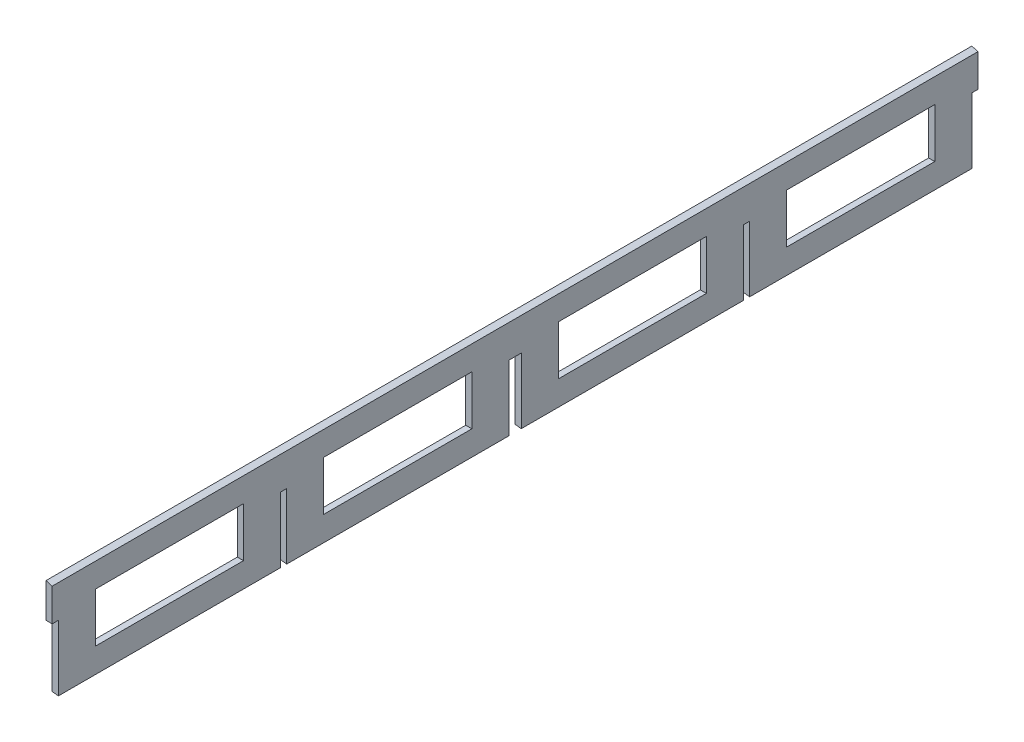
ISO-10303-21;
HEADER;
FILE_DESCRIPTION(('STEP AP214'),'2;1');
FILE_NAME('part.step','',(''),(''),'','','');
FILE_SCHEMA(('AUTOMOTIVE_DESIGN { 1 0 10303 214 1 1 1 1 }'));
ENDSEC;
DATA;
#1=APPLICATION_CONTEXT('core data for automotive mechanical design processes');
#2=APPLICATION_PROTOCOL_DEFINITION('international standard','automotive_design',2000,#1);
#3=PRODUCT_CONTEXT('',#1,'mechanical');
#4=PRODUCT('Part','Part','',(#3));
#5=PRODUCT_RELATED_PRODUCT_CATEGORY('part','',(#4));
#6=PRODUCT_DEFINITION_FORMATION('','',#4);
#7=PRODUCT_DEFINITION_CONTEXT('part definition',#1,'design');
#8=PRODUCT_DEFINITION('design','',#6,#7);
#9=PRODUCT_DEFINITION_SHAPE('','',#8);
#10=(LENGTH_UNIT() NAMED_UNIT(*) SI_UNIT(.MILLI.,.METRE.));
#11=(NAMED_UNIT(*) PLANE_ANGLE_UNIT() SI_UNIT($,.RADIAN.));
#12=(NAMED_UNIT(*) SI_UNIT($,.STERADIAN.) SOLID_ANGLE_UNIT());
#13=UNCERTAINTY_MEASURE_WITH_UNIT(LENGTH_MEASURE(1.E-05),#10,'distance_accuracy_value','');
#14=(GEOMETRIC_REPRESENTATION_CONTEXT(3) GLOBAL_UNCERTAINTY_ASSIGNED_CONTEXT((#13)) GLOBAL_UNIT_ASSIGNED_CONTEXT((#10,
#11,#12)) REPRESENTATION_CONTEXT('',''));
#15=CARTESIAN_POINT('',(0.,0.,0.));
#16=DIRECTION('',(0.,0.,1.));
#17=DIRECTION('',(1.,0.,0.));
#18=AXIS2_PLACEMENT_3D('',#15,#16,#17);
#19=CARTESIAN_POINT('',(321.6275,0.,300.12));
#20=DIRECTION('',(-1.,0.,0.));
#21=DIRECTION('',(0.,0.,1.));
#22=AXIS2_PLACEMENT_3D('',#19,#20,#21);
#23=PLANE('',#22);
#24=DIRECTION('',(0.,1.,0.));
#25=VECTOR('',#24,1.);
#26=CARTESIAN_POINT('',(321.6275,0.,377.825));
#27=LINE('',#26,#25);
#28=CARTESIAN_POINT('',(321.6275,-29.215196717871,377.825));
#29=VERTEX_POINT('',#28);
#30=CARTESIAN_POINT('',(321.6275,-3.81519671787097,377.825));
#31=VERTEX_POINT('',#30);
#32=EDGE_CURVE('E328',#29,#31,#27,.T.);
#33=ORIENTED_EDGE('',*,*,#32,.F.);
#34=DIRECTION('',(0.,0.,-1.));
#35=VECTOR('',#34,1.);
#36=CARTESIAN_POINT('',(321.6275,-29.215196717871,0.));
#37=LINE('',#36,#35);
#38=CARTESIAN_POINT('',(321.6275,-29.215196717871,454.025));
#39=VERTEX_POINT('',#38);
#40=EDGE_CURVE('E69',#39,#29,#37,.T.);
#41=ORIENTED_EDGE('',*,*,#40,.F.);
#42=DIRECTION('',(0.,1.,0.));
#43=VECTOR('',#42,1.);
#44=CARTESIAN_POINT('',(321.6275,0.,454.025));
#45=LINE('',#44,#43);
#46=CARTESIAN_POINT('',(321.6275,-3.81519671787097,454.025));
#47=VERTEX_POINT('',#46);
#48=EDGE_CURVE('E335',#39,#47,#45,.T.);
#49=ORIENTED_EDGE('',*,*,#48,.T.);
#50=DIRECTION('',(0.,0.,-1.));
#51=VECTOR('',#50,1.);
#52=CARTESIAN_POINT('',(321.6275,-3.81519671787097,0.));
#53=LINE('',#52,#51);
#54=EDGE_CURVE('E317',#47,#31,#53,.T.);
#55=ORIENTED_EDGE('',*,*,#54,.T.);
#56=EDGE_LOOP('',(#33,#41,#49,#55));
#57=FACE_BOUND('',#56,.T.);
#58=DIRECTION('',(0.,0.,1.));
#59=VECTOR('',#58,1.);
#60=CARTESIAN_POINT('',(321.6275,-29.2151967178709,0.));
#61=LINE('',#60,#59);
#62=CARTESIAN_POINT('',(321.6275,-29.2151967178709,22.225));
#63=VERTEX_POINT('',#62);
#64=CARTESIAN_POINT('',(321.6275,-29.2151967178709,98.425));
#65=VERTEX_POINT('',#64);
#66=EDGE_CURVE('E392',#63,#65,#61,.T.);
#67=ORIENTED_EDGE('',*,*,#66,.T.);
#68=DIRECTION('',(0.,1.,0.));
#69=VECTOR('',#68,1.);
#70=CARTESIAN_POINT('',(321.6275,0.,98.425));
#71=LINE('',#70,#69);
#72=CARTESIAN_POINT('',(321.6275,-3.81519671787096,98.425));
#73=VERTEX_POINT('',#72);
#74=EDGE_CURVE('E412',#65,#73,#71,.T.);
#75=ORIENTED_EDGE('',*,*,#74,.T.);
#76=DIRECTION('',(0.,0.,1.));
#77=VECTOR('',#76,1.);
#78=CARTESIAN_POINT('',(321.6275,-3.81519671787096,0.));
#79=LINE('',#78,#77);
#80=CARTESIAN_POINT('',(321.6275,-3.81519671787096,22.225));
#81=VERTEX_POINT('',#80);
#82=EDGE_CURVE('E424',#81,#73,#79,.T.);
#83=ORIENTED_EDGE('',*,*,#82,.F.);
#84=DIRECTION('',(0.,1.,0.));
#85=VECTOR('',#84,1.);
#86=CARTESIAN_POINT('',(321.6275,0.,22.225));
#87=LINE('',#86,#85);
#88=EDGE_CURVE('E428',#63,#81,#87,.T.);
#89=ORIENTED_EDGE('',*,*,#88,.F.);
#90=EDGE_LOOP('',(#67,#75,#83,#89));
#91=FACE_BOUND('',#90,.T.);
#92=DIRECTION('',(-1.12262810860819E-10,1.,0.));
#93=VECTOR('',#92,1.);
#94=CARTESIAN_POINT('',(321.627499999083,3.61068072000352E-08,117.475));
#95=LINE('',#94,#93);
#96=CARTESIAN_POINT('',(321.627500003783,-41.8683893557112,117.475));
#97=VERTEX_POINT('',#96);
#98=CARTESIAN_POINT('',(321.6275,-8.16744704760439,117.475));
#99=VERTEX_POINT('',#98);
#100=EDGE_CURVE('E445',#97,#99,#95,.T.);
#101=ORIENTED_EDGE('',*,*,#100,.F.);
#102=DIRECTION('',(0.,0.,1.));
#103=VECTOR('',#102,1.);
#104=CARTESIAN_POINT('',(321.627500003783,-41.8683893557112,142.974));
#105=LINE('',#104,#103);
#106=CARTESIAN_POINT('',(321.627500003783,-41.8683893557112,4.81200000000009));
#107=VERTEX_POINT('',#106);
#108=EDGE_CURVE('E747',#107,#97,#105,.T.);
#109=ORIENTED_EDGE('',*,*,#108,.F.);
#110=DIRECTION('',(0.,0.,1.));
#111=VECTOR('',#110,1.);
#112=CARTESIAN_POINT('',(321.627500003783,-41.8683893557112,-0.049999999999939));
#113=LINE('',#112,#111);
#114=CARTESIAN_POINT('',(321.627499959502,-41.8689674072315,3.17500000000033));
#115=VERTEX_POINT('',#114);
#116=EDGE_CURVE('E661',#115,#107,#113,.T.);
#117=ORIENTED_EDGE('',*,*,#116,.F.);
#118=DIRECTION('',(0.,1.,0.));
#119=VECTOR('',#118,1.);
#120=CARTESIAN_POINT('',(321.627499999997,25.3981079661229,3.175));
#121=LINE('',#120,#119);
#122=CARTESIAN_POINT('',(321.6275,-8.16744704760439,3.175));
#123=VERTEX_POINT('',#122);
#124=EDGE_CURVE('E568',#115,#123,#121,.T.);
#125=ORIENTED_EDGE('',*,*,#124,.T.);
#126=DIRECTION('',(0.,0.,-1.));
#127=VECTOR('',#126,1.);
#128=CARTESIAN_POINT('',(321.6275,-8.16744704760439,3.175));
#129=LINE('',#128,#127);
#130=CARTESIAN_POINT('',(321.6275,-8.16744704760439,0.));
#131=VERTEX_POINT('',#130);
#132=EDGE_CURVE('E696',#123,#131,#129,.T.);
#133=ORIENTED_EDGE('',*,*,#132,.T.);
#134=DIRECTION('',(0.,1.,0.));
#135=VECTOR('',#134,1.);
#136=CARTESIAN_POINT('',(321.627499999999,7.7872227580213,0.));
#137=LINE('',#136,#135);
#138=CARTESIAN_POINT('',(321.627500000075,8.64800941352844,0.));
#139=VERTEX_POINT('',#138);
#140=EDGE_CURVE('E680',#131,#139,#137,.T.);
#141=ORIENTED_EDGE('',*,*,#140,.T.);
#142=DIRECTION('',(0.,0.,-1.));
#143=VECTOR('',#142,1.);
#144=CARTESIAN_POINT('',(321.627500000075,8.64800941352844,3.175));
#145=LINE('',#144,#143);
#146=CARTESIAN_POINT('',(321.627499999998,8.64800941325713,476.25));
#147=VERTEX_POINT('',#146);
#148=EDGE_CURVE('E563',#147,#139,#145,.T.);
#149=ORIENTED_EDGE('',*,*,#148,.F.);
#150=DIRECTION('',(0.,-1.,0.));
#151=VECTOR('',#150,1.);
#152=CARTESIAN_POINT('',(321.627499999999,3.07909257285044E-11,476.25));
#153=LINE('',#152,#151);
#154=CARTESIAN_POINT('',(321.6275,-8.16744704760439,476.25));
#155=VERTEX_POINT('',#154);
#156=EDGE_CURVE('E668',#147,#155,#153,.T.);
#157=ORIENTED_EDGE('',*,*,#156,.T.);
#158=DIRECTION('',(0.,0.,1.));
#159=VECTOR('',#158,1.);
#160=CARTESIAN_POINT('',(321.6275,-8.16744704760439,473.075));
#161=LINE('',#160,#159);
#162=CARTESIAN_POINT('',(321.6275,-8.16744704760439,473.075));
#163=VERTEX_POINT('',#162);
#164=EDGE_CURVE('E662',#163,#155,#161,.T.);
#165=ORIENTED_EDGE('',*,*,#164,.F.);
#166=DIRECTION('',(0.,-1.,0.));
#167=VECTOR('',#166,1.);
#168=CARTESIAN_POINT('',(321.627499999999,3.07909257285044E-11,473.075));
#169=LINE('',#168,#167);
#170=CARTESIAN_POINT('',(321.627500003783,-41.8683893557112,473.075));
#171=VERTEX_POINT('',#170);
#172=EDGE_CURVE('E571',#163,#171,#169,.T.);
#173=ORIENTED_EDGE('',*,*,#172,.T.);
#174=DIRECTION('',(0.,0.,1.));
#175=VECTOR('',#174,1.);
#176=CARTESIAN_POINT('',(321.627500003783,-41.8683893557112,300.12));
#177=LINE('',#176,#175);
#178=CARTESIAN_POINT('',(321.627500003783,-41.8683893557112,358.775));
#179=VERTEX_POINT('',#178);
#180=EDGE_CURVE('E767',#179,#171,#177,.T.);
#181=ORIENTED_EDGE('',*,*,#180,.F.);
#182=DIRECTION('',(-1.12262810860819E-10,1.,0.));
#183=VECTOR('',#182,1.);
#184=CARTESIAN_POINT('',(321.627499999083,3.61068072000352E-08,358.775));
#185=LINE('',#184,#183);
#186=CARTESIAN_POINT('',(321.6275,-8.16744704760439,358.775));
#187=VERTEX_POINT('',#186);
#188=EDGE_CURVE('E549',#179,#187,#185,.T.);
#189=ORIENTED_EDGE('',*,*,#188,.T.);
#190=DIRECTION('',(0.,0.,1.));
#191=VECTOR('',#190,1.);
#192=CARTESIAN_POINT('',(321.6275,-8.16744704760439,355.6));
#193=LINE('',#192,#191);
#194=CARTESIAN_POINT('',(321.6275,-8.16744704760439,355.6));
#195=VERTEX_POINT('',#194);
#196=EDGE_CURVE('E539',#195,#187,#193,.T.);
#197=ORIENTED_EDGE('',*,*,#196,.F.);
#198=DIRECTION('',(-1.12262810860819E-10,1.,0.));
#199=VECTOR('',#198,1.);
#200=CARTESIAN_POINT('',(321.627499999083,3.61068072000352E-08,355.6));
#201=LINE('',#200,#199);
#202=CARTESIAN_POINT('',(321.627500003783,-41.8683893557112,355.6));
#203=VERTEX_POINT('',#202);
#204=EDGE_CURVE('E529',#203,#195,#201,.T.);
#205=ORIENTED_EDGE('',*,*,#204,.F.);
#206=CARTESIAN_POINT('',(321.627500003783,-41.8683893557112,300.12));
#207=VERTEX_POINT('',#206);
#208=EDGE_CURVE('E941',#207,#203,#177,.T.);
#209=ORIENTED_EDGE('',*,*,#208,.F.);
#210=CARTESIAN_POINT('',(321.627500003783,-41.8683893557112,241.3));
#211=VERTEX_POINT('',#210);
#212=EDGE_CURVE('E758',#211,#207,#105,.T.);
#213=ORIENTED_EDGE('',*,*,#212,.F.);
#214=DIRECTION('',(-1.12262810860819E-10,1.,0.));
#215=VECTOR('',#214,1.);
#216=CARTESIAN_POINT('',(321.627500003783,-41.8683893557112,241.3));
#217=LINE('',#216,#215);
#218=CARTESIAN_POINT('',(321.6275,-8.16744704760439,241.3));
#219=VERTEX_POINT('',#218);
#220=EDGE_CURVE('E489',#211,#219,#217,.T.);
#221=ORIENTED_EDGE('',*,*,#220,.T.);
#222=DIRECTION('',(0.,0.,1.));
#223=VECTOR('',#222,1.);
#224=CARTESIAN_POINT('',(321.6275,-8.16744704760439,234.95));
#225=LINE('',#224,#223);
#226=CARTESIAN_POINT('',(321.6275,-8.16744704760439,234.95));
#227=VERTEX_POINT('',#226);
#228=EDGE_CURVE('E479',#227,#219,#225,.T.);
#229=ORIENTED_EDGE('',*,*,#228,.F.);
#230=DIRECTION('',(-1.12262810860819E-10,1.,0.));
#231=VECTOR('',#230,1.);
#232=CARTESIAN_POINT('',(321.627500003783,-41.8683893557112,234.95));
#233=LINE('',#232,#231);
#234=CARTESIAN_POINT('',(321.627500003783,-41.8683893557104,234.95));
#235=VERTEX_POINT('',#234);
#236=EDGE_CURVE('E486',#235,#227,#233,.T.);
#237=ORIENTED_EDGE('',*,*,#236,.F.);
#238=CARTESIAN_POINT('',(321.627500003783,-41.8683893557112,161.958));
#239=VERTEX_POINT('',#238);
#240=EDGE_CURVE('E753',#239,#235,#105,.T.);
#241=ORIENTED_EDGE('',*,*,#240,.F.);
#242=CARTESIAN_POINT('',(321.627500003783,-41.8683893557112,156.958));
#243=VERTEX_POINT('',#242);
#244=EDGE_CURVE('E660',#243,#239,#113,.T.);
#245=ORIENTED_EDGE('',*,*,#244,.F.);
#246=CARTESIAN_POINT('',(321.627500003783,-41.8683893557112,120.65));
#247=VERTEX_POINT('',#246);
#248=EDGE_CURVE('E757',#247,#243,#105,.T.);
#249=ORIENTED_EDGE('',*,*,#248,.F.);
#250=DIRECTION('',(-1.12262810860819E-10,1.,0.));
#251=VECTOR('',#250,1.);
#252=CARTESIAN_POINT('',(321.627499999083,3.61068072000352E-08,120.65));
#253=LINE('',#252,#251);
#254=CARTESIAN_POINT('',(321.6275,-8.16744704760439,120.65));
#255=VERTEX_POINT('',#254);
#256=EDGE_CURVE('E465',#247,#255,#253,.T.);
#257=ORIENTED_EDGE('',*,*,#256,.T.);
#258=DIRECTION('',(0.,0.,1.));
#259=VECTOR('',#258,1.);
#260=CARTESIAN_POINT('',(321.6275,-8.16744704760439,117.475));
#261=LINE('',#260,#259);
#262=EDGE_CURVE('E455',#99,#255,#261,.T.);
#263=ORIENTED_EDGE('',*,*,#262,.F.);
#264=EDGE_LOOP('',(#101,#109,#117,#125,#133,#141,#149,#157,#165,#173,#181,#189,#197,#205,#209,
#213,#221,#229,#237,#241,#245,#249,#257,#263));
#265=FACE_BOUND('',#264,.T.);
#266=DIRECTION('',(0.,0.,1.));
#267=VECTOR('',#266,1.);
#268=CARTESIAN_POINT('',(321.6275,-29.215196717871,0.));
#269=LINE('',#268,#267);
#270=CARTESIAN_POINT('',(321.6275,-29.215196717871,260.35));
#271=VERTEX_POINT('',#270);
#272=CARTESIAN_POINT('',(321.6275,-29.215196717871,336.55));
#273=VERTEX_POINT('',#272);
#274=EDGE_CURVE('E404',#271,#273,#269,.T.);
#275=ORIENTED_EDGE('',*,*,#274,.T.);
#276=DIRECTION('',(0.,1.,0.));
#277=VECTOR('',#276,1.);
#278=CARTESIAN_POINT('',(321.6275,0.,336.55));
#279=LINE('',#278,#277);
#280=CARTESIAN_POINT('',(321.6275,-3.81519671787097,336.55));
#281=VERTEX_POINT('',#280);
#282=EDGE_CURVE('E382',#273,#281,#279,.T.);
#283=ORIENTED_EDGE('',*,*,#282,.T.);
#284=DIRECTION('',(0.,0.,1.));
#285=VECTOR('',#284,1.);
#286=CARTESIAN_POINT('',(321.6275,-3.81519671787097,0.));
#287=LINE('',#286,#285);
#288=CARTESIAN_POINT('',(321.6275,-3.81519671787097,260.35));
#289=VERTEX_POINT('',#288);
#290=EDGE_CURVE('E396',#289,#281,#287,.T.);
#291=ORIENTED_EDGE('',*,*,#290,.F.);
#292=DIRECTION('',(0.,1.,0.));
#293=VECTOR('',#292,1.);
#294=CARTESIAN_POINT('',(321.6275,0.,260.35));
#295=LINE('',#294,#293);
#296=EDGE_CURVE('E400',#271,#289,#295,.T.);
#297=ORIENTED_EDGE('',*,*,#296,.F.);
#298=EDGE_LOOP('',(#275,#283,#291,#297));
#299=FACE_BOUND('',#298,.T.);
#300=DIRECTION('',(0.,1.,0.));
#301=VECTOR('',#300,1.);
#302=CARTESIAN_POINT('',(321.6275,-29.2151967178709,215.9));
#303=LINE('',#302,#301);
#304=CARTESIAN_POINT('',(321.6275,-29.2151967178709,215.9));
#305=VERTEX_POINT('',#304);
#306=CARTESIAN_POINT('',(321.6275,-3.81519671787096,215.9));
#307=VERTEX_POINT('',#306);
#308=EDGE_CURVE('E77',#305,#307,#303,.T.);
#309=ORIENTED_EDGE('',*,*,#308,.T.);
#310=DIRECTION('',(0.,0.,-1.));
#311=VECTOR('',#310,1.);
#312=CARTESIAN_POINT('',(321.6275,-3.81519671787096,215.9));
#313=LINE('',#312,#311);
#314=CARTESIAN_POINT('',(321.6275,-3.81519671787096,139.7));
#315=VERTEX_POINT('',#314);
#316=EDGE_CURVE('E371',#307,#315,#313,.T.);
#317=ORIENTED_EDGE('',*,*,#316,.T.);
#318=DIRECTION('',(0.,1.,0.));
#319=VECTOR('',#318,1.);
#320=CARTESIAN_POINT('',(321.6275,-29.2151967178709,139.7));
#321=LINE('',#320,#319);
#322=CARTESIAN_POINT('',(321.6275,-29.2151967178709,139.7));
#323=VERTEX_POINT('',#322);
#324=EDGE_CURVE('E367',#323,#315,#321,.T.);
#325=ORIENTED_EDGE('',*,*,#324,.F.);
#326=DIRECTION('',(0.,0.,-1.));
#327=VECTOR('',#326,1.);
#328=CARTESIAN_POINT('',(321.6275,-29.2151967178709,215.9));
#329=LINE('',#328,#327);
#330=EDGE_CURVE('E363',#305,#323,#329,.T.);
#331=ORIENTED_EDGE('',*,*,#330,.F.);
#332=EDGE_LOOP('',(#309,#317,#325,#331));
#333=FACE_BOUND('',#332,.T.);
#334=ADVANCED_FACE('F53',(#57,#91,#265,#299,#333),#23,.F.);
#335=CARTESIAN_POINT('',(318.4525,0.,300.12));
#336=DIRECTION('',(-1.,0.,0.));
#337=DIRECTION('',(0.,0.,1.));
#338=AXIS2_PLACEMENT_3D('',#335,#336,#337);
#339=PLANE('',#338);
#340=DIRECTION('',(0.,0.,1.));
#341=VECTOR('',#340,1.);
#342=CARTESIAN_POINT('',(318.4525,-29.215196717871,300.12));
#343=LINE('',#342,#341);
#344=CARTESIAN_POINT('',(318.4525,-29.215196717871,377.825));
#345=VERTEX_POINT('',#344);
#346=CARTESIAN_POINT('',(318.4525,-29.215196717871,454.025));
#347=VERTEX_POINT('',#346);
#348=EDGE_CURVE('E11',#345,#347,#343,.T.);
#349=ORIENTED_EDGE('',*,*,#348,.F.);
#350=DIRECTION('',(0.,-1.,0.));
#351=VECTOR('',#350,1.);
#352=CARTESIAN_POINT('',(318.4525,0.,377.825));
#353=LINE('',#352,#351);
#354=CARTESIAN_POINT('',(318.4525,-3.81519671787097,377.825));
#355=VERTEX_POINT('',#354);
#356=EDGE_CURVE('E817',#355,#345,#353,.T.);
#357=ORIENTED_EDGE('',*,*,#356,.F.);
#358=DIRECTION('',(0.,0.,1.));
#359=VECTOR('',#358,1.);
#360=CARTESIAN_POINT('',(318.4525,-3.81519671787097,300.12));
#361=LINE('',#360,#359);
#362=CARTESIAN_POINT('',(318.4525,-3.81519671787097,454.025));
#363=VERTEX_POINT('',#362);
#364=EDGE_CURVE('E320',#355,#363,#361,.T.);
#365=ORIENTED_EDGE('',*,*,#364,.T.);
#366=DIRECTION('',(0.,-1.,0.));
#367=VECTOR('',#366,1.);
#368=CARTESIAN_POINT('',(318.4525,0.,454.025));
#369=LINE('',#368,#367);
#370=EDGE_CURVE('E62',#363,#347,#369,.T.);
#371=ORIENTED_EDGE('',*,*,#370,.T.);
#372=EDGE_LOOP('',(#349,#357,#365,#371));
#373=FACE_BOUND('',#372,.T.);
#374=DIRECTION('',(0.,0.,1.));
#375=VECTOR('',#374,1.);
#376=CARTESIAN_POINT('',(318.4525,-41.4884163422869,142.974));
#377=LINE('',#376,#375);
#378=CARTESIAN_POINT('',(318.452500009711,-41.4884163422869,4.81200000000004));
#379=VERTEX_POINT('',#378);
#380=CARTESIAN_POINT('',(318.452500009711,-41.4884163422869,117.475));
#381=VERTEX_POINT('',#380);
#382=EDGE_CURVE('E673',#379,#381,#377,.T.);
#383=ORIENTED_EDGE('',*,*,#382,.T.);
#384=DIRECTION('',(-2.91446723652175E-10,1.,0.));
#385=VECTOR('',#384,1.);
#386=CARTESIAN_POINT('',(318.45249999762,9.28119377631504E-08,117.475));
#387=LINE('',#386,#385);
#388=CARTESIAN_POINT('',(318.4525,-8.16744704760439,117.475));
#389=VERTEX_POINT('',#388);
#390=EDGE_CURVE('E435',#381,#389,#387,.T.);
#391=ORIENTED_EDGE('',*,*,#390,.T.);
#392=DIRECTION('',(0.,0.,1.));
#393=VECTOR('',#392,1.);
#394=CARTESIAN_POINT('',(318.4525,-8.16744704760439,117.475));
#395=LINE('',#394,#393);
#396=CARTESIAN_POINT('',(318.4525,-8.16744704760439,120.65));
#397=VERTEX_POINT('',#396);
#398=EDGE_CURVE('E475',#389,#397,#395,.T.);
#399=ORIENTED_EDGE('',*,*,#398,.T.);
#400=DIRECTION('',(-2.91446723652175E-10,1.,0.));
#401=VECTOR('',#400,1.);
#402=CARTESIAN_POINT('',(318.45249999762,9.28119377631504E-08,120.65));
#403=LINE('',#402,#401);
#404=CARTESIAN_POINT('',(318.452500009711,-41.4884163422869,120.65));
#405=VERTEX_POINT('',#404);
#406=EDGE_CURVE('E346',#405,#397,#403,.T.);
#407=ORIENTED_EDGE('',*,*,#406,.F.);
#408=CARTESIAN_POINT('',(318.452500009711,-41.4884163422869,156.958));
#409=VERTEX_POINT('',#408);
#410=EDGE_CURVE('E746',#405,#409,#377,.T.);
#411=ORIENTED_EDGE('',*,*,#410,.T.);
#412=DIRECTION('',(0.,0.,1.));
#413=VECTOR('',#412,1.);
#414=CARTESIAN_POINT('',(318.452500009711,-41.4884163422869,-0.049999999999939));
#415=LINE('',#414,#413);
#416=CARTESIAN_POINT('',(318.452500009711,-41.4884163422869,161.958));
#417=VERTEX_POINT('',#416);
#418=EDGE_CURVE('E708',#409,#417,#415,.T.);
#419=ORIENTED_EDGE('',*,*,#418,.T.);
#420=CARTESIAN_POINT('',(318.452500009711,-41.4884163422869,234.95));
#421=VERTEX_POINT('',#420);
#422=EDGE_CURVE('E648',#417,#421,#377,.T.);
#423=ORIENTED_EDGE('',*,*,#422,.T.);
#424=DIRECTION('',(2.91446723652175E-10,-1.,0.));
#425=VECTOR('',#424,1.);
#426=CARTESIAN_POINT('',(318.4525,-8.16744704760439,234.95));
#427=LINE('',#426,#425);
#428=CARTESIAN_POINT('',(318.4525,-8.16744704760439,234.95));
#429=VERTEX_POINT('',#428);
#430=EDGE_CURVE('E513',#429,#421,#427,.T.);
#431=ORIENTED_EDGE('',*,*,#430,.F.);
#432=DIRECTION('',(0.,0.,1.));
#433=VECTOR('',#432,1.);
#434=CARTESIAN_POINT('',(318.4525,-8.16744704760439,234.95));
#435=LINE('',#434,#433);
#436=CARTESIAN_POINT('',(318.4525,-8.16744704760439,241.3));
#437=VERTEX_POINT('',#436);
#438=EDGE_CURVE('E482',#429,#437,#435,.T.);
#439=ORIENTED_EDGE('',*,*,#438,.T.);
#440=DIRECTION('',(2.91446723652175E-10,-1.,0.));
#441=VECTOR('',#440,1.);
#442=CARTESIAN_POINT('',(318.4525,-8.16744704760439,241.3));
#443=LINE('',#442,#441);
#444=CARTESIAN_POINT('',(318.452500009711,-41.4884163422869,241.3));
#445=VERTEX_POINT('',#444);
#446=EDGE_CURVE('E497',#437,#445,#443,.T.);
#447=ORIENTED_EDGE('',*,*,#446,.T.);
#448=CARTESIAN_POINT('',(318.452500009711,-41.4884163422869,300.12));
#449=VERTEX_POINT('',#448);
#450=EDGE_CURVE('E969',#445,#449,#377,.T.);
#451=ORIENTED_EDGE('',*,*,#450,.T.);
#452=DIRECTION('',(0.,0.,1.));
#453=VECTOR('',#452,1.);
#454=CARTESIAN_POINT('',(318.452500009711,-41.4884163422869,300.12));
#455=LINE('',#454,#453);
#456=CARTESIAN_POINT('',(318.452500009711,-41.4884163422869,355.6));
#457=VERTEX_POINT('',#456);
#458=EDGE_CURVE('E933',#449,#457,#455,.T.);
#459=ORIENTED_EDGE('',*,*,#458,.T.);
#460=DIRECTION('',(-2.91446723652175E-10,1.,0.));
#461=VECTOR('',#460,1.);
#462=CARTESIAN_POINT('',(318.45249999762,9.28119377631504E-08,355.6));
#463=LINE('',#462,#461);
#464=CARTESIAN_POINT('',(318.4525,-8.16744704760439,355.6));
#465=VERTEX_POINT('',#464);
#466=EDGE_CURVE('E519',#457,#465,#463,.T.);
#467=ORIENTED_EDGE('',*,*,#466,.T.);
#468=DIRECTION('',(0.,0.,1.));
#469=VECTOR('',#468,1.);
#470=CARTESIAN_POINT('',(318.4525,-8.16744704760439,355.6));
#471=LINE('',#470,#469);
#472=CARTESIAN_POINT('',(318.4525,-8.16744704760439,358.775));
#473=VERTEX_POINT('',#472);
#474=EDGE_CURVE('E559',#465,#473,#471,.T.);
#475=ORIENTED_EDGE('',*,*,#474,.T.);
#476=DIRECTION('',(-2.91446723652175E-10,1.,0.));
#477=VECTOR('',#476,1.);
#478=CARTESIAN_POINT('',(318.45249999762,9.28119377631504E-08,358.775));
#479=LINE('',#478,#477);
#480=CARTESIAN_POINT('',(318.452500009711,-41.4884163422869,358.775));
#481=VERTEX_POINT('',#480);
#482=EDGE_CURVE('E505',#481,#473,#479,.T.);
#483=ORIENTED_EDGE('',*,*,#482,.F.);
#484=CARTESIAN_POINT('',(318.452500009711,-41.4884163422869,473.075));
#485=VERTEX_POINT('',#484);
#486=EDGE_CURVE('E963',#481,#485,#455,.T.);
#487=ORIENTED_EDGE('',*,*,#486,.T.);
#488=DIRECTION('',(0.,-1.,0.));
#489=VECTOR('',#488,1.);
#490=CARTESIAN_POINT('',(318.4525,0.,473.075));
#491=LINE('',#490,#489);
#492=CARTESIAN_POINT('',(318.4525,-8.16744704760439,473.075));
#493=VERTEX_POINT('',#492);
#494=EDGE_CURVE('E690',#493,#485,#491,.T.);
#495=ORIENTED_EDGE('',*,*,#494,.F.);
#496=DIRECTION('',(0.,0.,1.));
#497=VECTOR('',#496,1.);
#498=CARTESIAN_POINT('',(318.4525,-8.16744704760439,473.075));
#499=LINE('',#498,#497);
#500=CARTESIAN_POINT('',(318.4525,-8.16744704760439,476.25));
#501=VERTEX_POINT('',#500);
#502=EDGE_CURVE('E670',#493,#501,#499,.T.);
#503=ORIENTED_EDGE('',*,*,#502,.T.);
#504=DIRECTION('',(0.,-1.,0.));
#505=VECTOR('',#504,1.);
#506=CARTESIAN_POINT('',(318.4525,0.,476.25));
#507=LINE('',#506,#505);
#508=CARTESIAN_POINT('',(318.452499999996,9.54073651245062,476.25));
#509=VERTEX_POINT('',#508);
#510=EDGE_CURVE('E681',#509,#501,#507,.T.);
#511=ORIENTED_EDGE('',*,*,#510,.F.);
#512=DIRECTION('',(0.,0.,1.));
#513=VECTOR('',#512,1.);
#514=CARTESIAN_POINT('',(318.452499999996,9.54073651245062,-0.049999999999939));
#515=LINE('',#514,#513);
#516=CARTESIAN_POINT('',(318.4525,9.54073651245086,0.));
#517=VERTEX_POINT('',#516);
#518=EDGE_CURVE('E982',#517,#509,#515,.T.);
#519=ORIENTED_EDGE('',*,*,#518,.F.);
#520=DIRECTION('',(0.,1.,0.));
#521=VECTOR('',#520,1.);
#522=CARTESIAN_POINT('',(318.4525,7.78722275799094,0.));
#523=LINE('',#522,#521);
#524=CARTESIAN_POINT('',(318.4525,-8.16744704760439,0.));
#525=VERTEX_POINT('',#524);
#526=EDGE_CURVE('E724',#525,#517,#523,.T.);
#527=ORIENTED_EDGE('',*,*,#526,.F.);
#528=DIRECTION('',(0.,0.,-1.));
#529=VECTOR('',#528,1.);
#530=CARTESIAN_POINT('',(318.4525,-8.16744704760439,3.175));
#531=LINE('',#530,#529);
#532=CARTESIAN_POINT('',(318.4525,-8.16744704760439,3.175));
#533=VERTEX_POINT('',#532);
#534=EDGE_CURVE('E692',#533,#525,#531,.T.);
#535=ORIENTED_EDGE('',*,*,#534,.F.);
#536=DIRECTION('',(0.,1.,0.));
#537=VECTOR('',#536,1.);
#538=CARTESIAN_POINT('',(318.4525,25.3981079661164,3.175));
#539=LINE('',#538,#537);
#540=CARTESIAN_POINT('',(318.452499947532,-41.4889546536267,3.17500000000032));
#541=VERTEX_POINT('',#540);
#542=EDGE_CURVE('E575',#541,#533,#539,.T.);
#543=ORIENTED_EDGE('',*,*,#542,.F.);
#544=EDGE_CURVE('E572',#541,#379,#415,.T.);
#545=ORIENTED_EDGE('',*,*,#544,.T.);
#546=EDGE_LOOP('',(#383,#391,#399,#407,#411,#419,#423,#431,#439,#447,#451,#459,#467,#475,#483,
#487,#495,#503,#511,#519,#527,#535,#543,#545));
#547=FACE_BOUND('',#546,.T.);
#548=DIRECTION('',(0.,-1.,0.));
#549=VECTOR('',#548,1.);
#550=CARTESIAN_POINT('',(318.4525,0.,336.55));
#551=LINE('',#550,#549);
#552=CARTESIAN_POINT('',(318.4525,-3.81519671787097,336.55));
#553=VERTEX_POINT('',#552);
#554=CARTESIAN_POINT('',(318.4525,-29.215196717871,336.55));
#555=VERTEX_POINT('',#554);
#556=EDGE_CURVE('E779',#553,#555,#551,.T.);
#557=ORIENTED_EDGE('',*,*,#556,.T.);
#558=DIRECTION('',(0.,0.,-1.));
#559=VECTOR('',#558,1.);
#560=CARTESIAN_POINT('',(318.4525,-29.215196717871,300.12));
#561=LINE('',#560,#559);
#562=CARTESIAN_POINT('',(318.4525,-29.215196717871,260.35));
#563=VERTEX_POINT('',#562);
#564=EDGE_CURVE('E783',#555,#563,#561,.T.);
#565=ORIENTED_EDGE('',*,*,#564,.T.);
#566=DIRECTION('',(0.,-1.,0.));
#567=VECTOR('',#566,1.);
#568=CARTESIAN_POINT('',(318.4525,0.,260.35));
#569=LINE('',#568,#567);
#570=CARTESIAN_POINT('',(318.4525,-3.81519671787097,260.35));
#571=VERTEX_POINT('',#570);
#572=EDGE_CURVE('E772',#571,#563,#569,.T.);
#573=ORIENTED_EDGE('',*,*,#572,.F.);
#574=DIRECTION('',(0.,0.,-1.));
#575=VECTOR('',#574,1.);
#576=CARTESIAN_POINT('',(318.4525,-3.81519671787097,300.12));
#577=LINE('',#576,#575);
#578=EDGE_CURVE('E775',#553,#571,#577,.T.);
#579=ORIENTED_EDGE('',*,*,#578,.F.);
#580=EDGE_LOOP('',(#557,#565,#573,#579));
#581=FACE_BOUND('',#580,.T.);
#582=DIRECTION('',(0.,-1.,0.));
#583=VECTOR('',#582,1.);
#584=CARTESIAN_POINT('',(318.4525,0.,98.425));
#585=LINE('',#584,#583);
#586=CARTESIAN_POINT('',(318.4525,-3.81519671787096,98.425));
#587=VERTEX_POINT('',#586);
#588=CARTESIAN_POINT('',(318.4525,-29.2151967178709,98.425));
#589=VERTEX_POINT('',#588);
#590=EDGE_CURVE('E794',#587,#589,#585,.T.);
#591=ORIENTED_EDGE('',*,*,#590,.T.);
#592=DIRECTION('',(0.,0.,-1.));
#593=VECTOR('',#592,1.);
#594=CARTESIAN_POINT('',(318.4525,-29.2151967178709,300.12));
#595=LINE('',#594,#593);
#596=CARTESIAN_POINT('',(318.4525,-29.2151967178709,22.225));
#597=VERTEX_POINT('',#596);
#598=EDGE_CURVE('E798',#589,#597,#595,.T.);
#599=ORIENTED_EDGE('',*,*,#598,.T.);
#600=DIRECTION('',(0.,-1.,0.));
#601=VECTOR('',#600,1.);
#602=CARTESIAN_POINT('',(318.4525,0.,22.225));
#603=LINE('',#602,#601);
#604=CARTESIAN_POINT('',(318.4525,-3.81519671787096,22.225));
#605=VERTEX_POINT('',#604);
#606=EDGE_CURVE('E787',#605,#597,#603,.T.);
#607=ORIENTED_EDGE('',*,*,#606,.F.);
#608=DIRECTION('',(0.,0.,-1.));
#609=VECTOR('',#608,1.);
#610=CARTESIAN_POINT('',(318.4525,-3.81519671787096,300.12));
#611=LINE('',#610,#609);
#612=EDGE_CURVE('E790',#587,#605,#611,.T.);
#613=ORIENTED_EDGE('',*,*,#612,.F.);
#614=EDGE_LOOP('',(#591,#599,#607,#613));
#615=FACE_BOUND('',#614,.T.);
#616=DIRECTION('',(0.,0.,1.));
#617=VECTOR('',#616,1.);
#618=CARTESIAN_POINT('',(318.4525,-3.81519671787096,300.12));
#619=LINE('',#618,#617);
#620=CARTESIAN_POINT('',(318.4525,-3.81519671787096,139.7));
#621=VERTEX_POINT('',#620);
#622=CARTESIAN_POINT('',(318.4525,-3.81519671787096,215.9));
#623=VERTEX_POINT('',#622);
#624=EDGE_CURVE('E809',#621,#623,#619,.T.);
#625=ORIENTED_EDGE('',*,*,#624,.T.);
#626=DIRECTION('',(0.,-1.,0.));
#627=VECTOR('',#626,1.);
#628=CARTESIAN_POINT('',(318.4525,0.,215.9));
#629=LINE('',#628,#627);
#630=CARTESIAN_POINT('',(318.4525,-29.2151967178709,215.9));
#631=VERTEX_POINT('',#630);
#632=EDGE_CURVE('E813',#623,#631,#629,.T.);
#633=ORIENTED_EDGE('',*,*,#632,.T.);
#634=DIRECTION('',(0.,0.,1.));
#635=VECTOR('',#634,1.);
#636=CARTESIAN_POINT('',(318.4525,-29.2151967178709,300.12));
#637=LINE('',#636,#635);
#638=CARTESIAN_POINT('',(318.4525,-29.2151967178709,139.7));
#639=VERTEX_POINT('',#638);
#640=EDGE_CURVE('E802',#639,#631,#637,.T.);
#641=ORIENTED_EDGE('',*,*,#640,.F.);
#642=DIRECTION('',(0.,-1.,0.));
#643=VECTOR('',#642,1.);
#644=CARTESIAN_POINT('',(318.4525,0.,139.7));
#645=LINE('',#644,#643);
#646=EDGE_CURVE('E805',#621,#639,#645,.T.);
#647=ORIENTED_EDGE('',*,*,#646,.F.);
#648=EDGE_LOOP('',(#625,#633,#641,#647));
#649=FACE_BOUND('',#648,.T.);
#650=ADVANCED_FACE('F627',(#373,#547,#581,#615,#649),#339,.T.);
#651=CARTESIAN_POINT('',(318.452500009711,-41.4884163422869,142.974));
#652=CARTESIAN_POINT('',(319.328636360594,-41.592822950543,142.974));
#653=CARTESIAN_POINT('',(320.386981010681,-41.719386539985,142.974));
#654=CARTESIAN_POINT('',(321.445261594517,-41.8464863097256,142.974));
#655=CARTESIAN_POINT('',(321.627500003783,-41.8683893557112,142.974));
#656=B_SPLINE_CURVE_WITH_KNOTS('',3,(#651,#652,#653,#654,#655),.UNSPECIFIED.,.F.,.F.,(4,1,4),
(0.,0.827795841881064,1.),.UNSPECIFIED.);
#657=DIRECTION('',(0.,0.,1.));
#658=VECTOR('',#657,1.);
#659=SURFACE_OF_LINEAR_EXTRUSION('',#656,#658);
#660=ORIENTED_EDGE('',*,*,#108,.T.);
#661=CARTESIAN_POINT('',(318.452500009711,-41.4884163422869,117.475));
#662=CARTESIAN_POINT('',(319.510896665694,-41.6145423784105,117.475));
#663=CARTESIAN_POINT('',(320.569230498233,-41.7411970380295,117.475));
#664=CARTESIAN_POINT('',(321.627500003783,-41.8683893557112,117.475));
#665=B_SPLINE_CURVE_WITH_KNOTS('',3,(#661,#662,#663,#664),.UNSPECIFIED.,.F.,.F.,(4,4),
(0.803216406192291,0.80610079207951),.UNSPECIFIED.);
#666=EDGE_CURVE('E439',#381,#97,#665,.T.);
#667=ORIENTED_EDGE('',*,*,#666,.F.);
#668=ORIENTED_EDGE('',*,*,#382,.F.);
#669=CARTESIAN_POINT('',(318.452500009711,-41.4884163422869,4.81200000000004));
#670=CARTESIAN_POINT('',(319.328636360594,-41.592822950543,4.81200000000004));
#671=CARTESIAN_POINT('',(320.386981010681,-41.719386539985,4.81200000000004));
#672=CARTESIAN_POINT('',(321.445261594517,-41.8464863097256,4.81200000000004));
#673=CARTESIAN_POINT('',(321.627500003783,-41.8683893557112,4.81200000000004));
#674=B_SPLINE_CURVE_WITH_KNOTS('',3,(#669,#670,#671,#672,#673),.UNSPECIFIED.,.F.,.F.,(4,1,4),
(0.,0.827795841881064,1.),.UNSPECIFIED.);
#675=EDGE_CURVE('E651',#107,#379,#674,.F.);
#676=ORIENTED_EDGE('',*,*,#675,.F.);
#677=EDGE_LOOP('',(#660,#667,#668,#676));
#678=FACE_BOUND('',#677,.T.);
#679=ADVANCED_FACE('F622',(#678),#659,.T.);
#680=ORIENTED_EDGE('',*,*,#240,.T.);
#681=CARTESIAN_POINT('',(-57.1197458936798,-3193.17113705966,234.95));
#682=DIRECTION('',(0.,0.,1.));
#683=DIRECTION('',(1.,0.,0.));
#684=AXIS2_PLACEMENT_3D('',#681,#682,#683);
#685=CIRCLE('',#684,3173.9814876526);
#686=EDGE_CURVE('E509',#235,#421,#685,.T.);
#687=ORIENTED_EDGE('',*,*,#686,.T.);
#688=ORIENTED_EDGE('',*,*,#422,.F.);
#689=CARTESIAN_POINT('',(321.627500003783,-41.8683893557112,161.958));
#690=CARTESIAN_POINT('',(321.362932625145,-41.8365912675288,161.958));
#691=CARTESIAN_POINT('',(321.098361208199,-41.8048267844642,161.958));
#692=CARTESIAN_POINT('',(320.569210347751,-41.7413647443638,161.958));
#693=CARTESIAN_POINT('',(320.304630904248,-41.7096671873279,161.958));
#694=CARTESIAN_POINT('',(319.510880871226,-41.6146745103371,161.958));
#695=CARTESIAN_POINT('',(318.981698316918,-41.5514793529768,161.958));
#696=CARTESIAN_POINT('',(318.452500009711,-41.4884163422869,161.958));
#697=B_SPLINE_CURVE_WITH_KNOTS('',3,(#689,#690,#691,#692,#693,#694,#695,#696),.UNSPECIFIED.,.F.,
.F.,(4,2,2,4),(0.,0.799414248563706,1.5988284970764,3.19765620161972),.UNSPECIFIED.);
#698=EDGE_CURVE('E712',#239,#417,#697,.T.);
#699=ORIENTED_EDGE('',*,*,#698,.F.);
#700=EDGE_LOOP('',(#680,#687,#688,#699));
#701=FACE_BOUND('',#700,.T.);
#702=ADVANCED_FACE('F1055',(#701),#659,.T.);
#703=CARTESIAN_POINT('',(533.4,-74.964481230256,476.25));
#704=CARTESIAN_POINT('',(533.393468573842,-74.3592932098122,476.25));
#705=CARTESIAN_POINT('',(531.326375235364,-72.9726299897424,476.25));
#706=CARTESIAN_POINT('',(527.400147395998,-71.2980390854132,476.25));
#707=CARTESIAN_POINT('',(520.602221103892,-67.7648945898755,476.25));
#708=CARTESIAN_POINT('',(511.347792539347,-63.3267299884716,476.25));
#709=CARTESIAN_POINT('',(499.502755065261,-57.6778186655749,476.25));
#710=CARTESIAN_POINT('',(485.246764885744,-51.1384096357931,476.25));
#711=CARTESIAN_POINT('',(468.676978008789,-43.8036364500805,476.25));
#712=CARTESIAN_POINT('',(449.947936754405,-35.8757202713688,476.25));
#713=CARTESIAN_POINT('',(429.230598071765,-27.5332286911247,476.25));
#714=CARTESIAN_POINT('',(406.718257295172,-18.9792879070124,476.25));
#715=CARTESIAN_POINT('',(382.640885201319,-10.382344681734,476.25));
#716=CARTESIAN_POINT('',(357.234331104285,-1.94698223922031,476.25));
#717=CARTESIAN_POINT('',(330.760171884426,6.14483374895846,476.25));
#718=CARTESIAN_POINT('',(303.50010629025,13.7381782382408,476.25));
#719=CARTESIAN_POINT('',(275.749595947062,20.6681404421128,476.25));
#720=CARTESIAN_POINT('',(247.797497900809,26.795319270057,476.25));
#721=CARTESIAN_POINT('',(219.77579834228,32.1343026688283,476.25));
#722=CARTESIAN_POINT('',(191.912986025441,36.1053653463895,476.25));
#723=CARTESIAN_POINT('',(164.569256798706,38.4384325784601,476.25));
#724=CARTESIAN_POINT('',(138.326668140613,39.1929872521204,476.25));
#725=CARTESIAN_POINT('',(113.549606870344,38.4856846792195,476.25));
#726=CARTESIAN_POINT('',(90.5807469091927,36.4479003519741,476.25));
#727=CARTESIAN_POINT('',(69.7330173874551,33.2891377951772,476.25));
#728=CARTESIAN_POINT('',(51.2766476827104,29.241370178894,476.25));
#729=CARTESIAN_POINT('',(35.4362610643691,24.539415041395,476.25));
#730=CARTESIAN_POINT('',(22.3884874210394,19.4234784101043,476.25));
#731=CARTESIAN_POINT('',(12.2196962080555,14.1253370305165,476.25));
#732=CARTESIAN_POINT('',(4.99901469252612,8.78084818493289,476.25));
#733=CARTESIAN_POINT('',(0.528637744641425,3.39704674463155,476.25));
#734=CARTESIAN_POINT('',(-0.609774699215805,-2.47889500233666,476.25));
#735=CARTESIAN_POINT('',(2.2546949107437,-7.70032156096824,476.25));
#736=CARTESIAN_POINT('',(8.00374597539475,-11.5081485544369,476.25));
#737=CARTESIAN_POINT('',(16.1982900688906,-14.6095937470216,476.25));
#738=CARTESIAN_POINT('',(26.9584985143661,-17.1149449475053,476.25));
#739=CARTESIAN_POINT('',(40.1607249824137,-19.119889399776,476.25));
#740=CARTESIAN_POINT('',(55.6666229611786,-20.6931815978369,476.25));
#741=CARTESIAN_POINT('',(73.2848054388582,-21.9411220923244,476.25));
#742=CARTESIAN_POINT('',(92.8177540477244,-22.9728124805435,476.25));
#743=CARTESIAN_POINT('',(114.052803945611,-23.9452202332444,476.25));
#744=CARTESIAN_POINT('',(136.779007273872,-24.9935512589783,476.25));
#745=CARTESIAN_POINT('',(160.778166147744,-26.2653553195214,476.25));
#746=CARTESIAN_POINT('',(185.828467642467,-27.915792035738,476.25));
#747=CARTESIAN_POINT('',(211.89529547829,-30.1378921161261,476.25));
#748=CARTESIAN_POINT('',(238.754061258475,-32.8568494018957,476.25));
#749=CARTESIAN_POINT('',(266.18062536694,-35.6241165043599,476.25));
#750=CARTESIAN_POINT('',(293.670265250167,-38.5940579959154,476.25));
#751=CARTESIAN_POINT('',(320.914949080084,-41.7432849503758,476.25));
#752=CARTESIAN_POINT('',(347.620557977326,-45.0642539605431,476.25));
#753=CARTESIAN_POINT('',(373.491842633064,-48.5288730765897,476.25));
#754=CARTESIAN_POINT('',(398.242667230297,-52.0819020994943,476.25));
#755=CARTESIAN_POINT('',(421.599418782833,-55.6440146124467,476.25));
#756=CARTESIAN_POINT('',(443.29349060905,-59.1670522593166,476.25));
#757=CARTESIAN_POINT('',(463.083690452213,-62.5183563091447,476.25));
#758=CARTESIAN_POINT('',(480.742383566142,-65.6572438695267,476.25));
#759=CARTESIAN_POINT('',(496.042405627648,-68.4378938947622,476.25));
#760=CARTESIAN_POINT('',(508.873832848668,-70.9319094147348,476.25));
#761=CARTESIAN_POINT('',(518.888745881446,-72.641498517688,476.25));
#762=CARTESIAN_POINT('',(526.44030087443,-74.6129246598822,476.25));
#763=CARTESIAN_POINT('',(530.448180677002,-74.5383148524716,476.25));
#764=CARTESIAN_POINT('',(533.132177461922,-76.0695207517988,476.25));
#765=CARTESIAN_POINT('',(533.402547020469,-75.2004827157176,476.25));
#766=CARTESIAN_POINT('',(533.4,-74.964481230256,476.25));
#767=B_SPLINE_CURVE_WITH_KNOTS('',3,(#703,#704,#705,#706,#707,#708,#709,#710,#711,#712,#713,
#714,#715,#716,#717,#718,#719,#720,#721,#722,#723,#724,#725,#726,#727,#728,#729,#730,#731,#732,
#733,#734,#735,#736,#737,#738,#739,#740,#741,#742,#743,#744,#745,#746,#747,#748,#749,#750,#751,
#752,#753,#754,#755,#756,#757,#758,#759,#760,#761,#762,#763,#764,#765,#766),.UNSPECIFIED.,.T.,
.F.,(4,1,1,1,1,1,1,1,1,1,1,1,1,1,1,1,1,1,1,1,1,1,1,1,1,1,1,1,1,1,1,1,1,1,1,1,1,1,1,1,1,1,1,1,1,
1,1,1,1,1,1,1,1,1,1,1,1,1,1,1,1,4),(0.,0.00157509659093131,0.00566746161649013,
0.0124361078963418,0.0218013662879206,0.0336583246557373,0.0478653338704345,0.0642720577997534,
0.0826832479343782,0.102902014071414,0.124705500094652,0.147849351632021,0.17208133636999,
0.197142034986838,0.222755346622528,0.248649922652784,0.274532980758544,0.300183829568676,
0.325827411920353,0.35065745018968,0.37440722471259,0.396834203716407,0.417695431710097,
0.436768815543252,0.45385571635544,0.46878827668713,0.481435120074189,0.491734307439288,
0.499717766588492,0.505647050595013,0.510284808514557,0.51492307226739,0.520799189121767,
0.528612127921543,0.538559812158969,0.550634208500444,0.564731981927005,0.580723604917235,
0.598426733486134,0.617662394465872,0.638248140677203,0.659991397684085,0.682696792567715,
0.70618055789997,0.730782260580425,0.755750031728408,0.780776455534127,0.805604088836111,
0.829967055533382,0.853600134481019,0.876238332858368,0.897630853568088,0.917536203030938,
0.935711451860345,0.951952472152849,0.966054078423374,0.977844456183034,0.987176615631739,
0.993932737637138,0.998018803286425,0.999385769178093,1.),.UNSPECIFIED.);
#768=DIRECTION('',(0.,0.,-1.));
#769=VECTOR('',#768,1.);
#770=SURFACE_OF_LINEAR_EXTRUSION('',#767,#769);
#771=CARTESIAN_POINT('',(318.452500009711,-41.4884163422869,355.6));
#772=CARTESIAN_POINT('',(319.510896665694,-41.6145423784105,355.6));
#773=CARTESIAN_POINT('',(320.569230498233,-41.7411970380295,355.6));
#774=CARTESIAN_POINT('',(321.627500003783,-41.8683893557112,355.6));
#775=B_SPLINE_CURVE_WITH_KNOTS('',3,(#771,#772,#773,#774),.UNSPECIFIED.,.F.,.F.,(4,4),
(0.803216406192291,0.80610079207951),.UNSPECIFIED.);
#776=EDGE_CURVE('E523',#457,#203,#775,.T.);
#777=ORIENTED_EDGE('',*,*,#776,.F.);
#778=ORIENTED_EDGE('',*,*,#458,.F.);
#779=CARTESIAN_POINT('',(533.4,-74.964481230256,300.12));
#780=CARTESIAN_POINT('',(533.393468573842,-74.3592932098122,300.12));
#781=CARTESIAN_POINT('',(531.326375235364,-72.9726299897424,300.12));
#782=CARTESIAN_POINT('',(527.400147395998,-71.2980390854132,300.12));
#783=CARTESIAN_POINT('',(520.602221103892,-67.7648945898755,300.12));
#784=CARTESIAN_POINT('',(511.347792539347,-63.3267299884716,300.12));
#785=CARTESIAN_POINT('',(499.502755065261,-57.6778186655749,300.12));
#786=CARTESIAN_POINT('',(485.246764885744,-51.1384096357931,300.12));
#787=CARTESIAN_POINT('',(468.676978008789,-43.8036364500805,300.12));
#788=CARTESIAN_POINT('',(449.947936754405,-35.8757202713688,300.12));
#789=CARTESIAN_POINT('',(429.230598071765,-27.5332286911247,300.12));
#790=CARTESIAN_POINT('',(406.718257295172,-18.9792879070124,300.12));
#791=CARTESIAN_POINT('',(382.640885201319,-10.382344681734,300.12));
#792=CARTESIAN_POINT('',(357.234331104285,-1.94698223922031,300.12));
#793=CARTESIAN_POINT('',(330.760171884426,6.14483374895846,300.12));
#794=CARTESIAN_POINT('',(303.50010629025,13.7381782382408,300.12));
#795=CARTESIAN_POINT('',(275.749595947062,20.6681404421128,300.12));
#796=CARTESIAN_POINT('',(247.797497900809,26.795319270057,300.12));
#797=CARTESIAN_POINT('',(219.77579834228,32.1343026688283,300.12));
#798=CARTESIAN_POINT('',(191.912986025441,36.1053653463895,300.12));
#799=CARTESIAN_POINT('',(164.569256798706,38.4384325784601,300.12));
#800=CARTESIAN_POINT('',(138.326668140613,39.1929872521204,300.12));
#801=CARTESIAN_POINT('',(113.549606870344,38.4856846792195,300.12));
#802=CARTESIAN_POINT('',(90.5807469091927,36.4479003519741,300.12));
#803=CARTESIAN_POINT('',(69.7330173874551,33.2891377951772,300.12));
#804=CARTESIAN_POINT('',(51.2766476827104,29.241370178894,300.12));
#805=CARTESIAN_POINT('',(35.4362610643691,24.539415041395,300.12));
#806=CARTESIAN_POINT('',(22.3884874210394,19.4234784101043,300.12));
#807=CARTESIAN_POINT('',(12.2196962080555,14.1253370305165,300.12));
#808=CARTESIAN_POINT('',(4.99901469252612,8.78084818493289,300.12));
#809=CARTESIAN_POINT('',(0.528637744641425,3.39704674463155,300.12));
#810=CARTESIAN_POINT('',(-0.609774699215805,-2.47889500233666,300.12));
#811=CARTESIAN_POINT('',(2.2546949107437,-7.70032156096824,300.12));
#812=CARTESIAN_POINT('',(8.00374597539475,-11.5081485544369,300.12));
#813=CARTESIAN_POINT('',(16.1982900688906,-14.6095937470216,300.12));
#814=CARTESIAN_POINT('',(26.9584985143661,-17.1149449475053,300.12));
#815=CARTESIAN_POINT('',(40.1607249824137,-19.119889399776,300.12));
#816=CARTESIAN_POINT('',(55.6666229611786,-20.6931815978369,300.12));
#817=CARTESIAN_POINT('',(73.2848054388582,-21.9411220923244,300.12));
#818=CARTESIAN_POINT('',(92.8177540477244,-22.9728124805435,300.12));
#819=CARTESIAN_POINT('',(114.052803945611,-23.9452202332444,300.12));
#820=CARTESIAN_POINT('',(136.779007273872,-24.9935512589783,300.12));
#821=CARTESIAN_POINT('',(160.778166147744,-26.2653553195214,300.12));
#822=CARTESIAN_POINT('',(185.828467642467,-27.915792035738,300.12));
#823=CARTESIAN_POINT('',(211.89529547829,-30.1378921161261,300.12));
#824=CARTESIAN_POINT('',(238.754061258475,-32.8568494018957,300.12));
#825=CARTESIAN_POINT('',(266.18062536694,-35.6241165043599,300.12));
#826=CARTESIAN_POINT('',(293.670265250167,-38.5940579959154,300.12));
#827=CARTESIAN_POINT('',(320.914949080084,-41.7432849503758,300.12));
#828=CARTESIAN_POINT('',(347.620557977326,-45.0642539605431,300.12));
#829=CARTESIAN_POINT('',(373.491842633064,-48.5288730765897,300.12));
#830=CARTESIAN_POINT('',(398.242667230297,-52.0819020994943,300.12));
#831=CARTESIAN_POINT('',(421.599418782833,-55.6440146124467,300.12));
#832=CARTESIAN_POINT('',(443.29349060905,-59.1670522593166,300.12));
#833=CARTESIAN_POINT('',(463.083690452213,-62.5183563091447,300.12));
#834=CARTESIAN_POINT('',(480.742383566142,-65.6572438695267,300.12));
#835=CARTESIAN_POINT('',(496.042405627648,-68.4378938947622,300.12));
#836=CARTESIAN_POINT('',(508.873832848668,-70.9319094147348,300.12));
#837=CARTESIAN_POINT('',(518.888745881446,-72.641498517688,300.12));
#838=CARTESIAN_POINT('',(526.44030087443,-74.6129246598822,300.12));
#839=CARTESIAN_POINT('',(530.448180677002,-74.5383148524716,300.12));
#840=CARTESIAN_POINT('',(533.132177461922,-76.0695207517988,300.12));
#841=CARTESIAN_POINT('',(533.402547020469,-75.2004827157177,300.12));
#842=CARTESIAN_POINT('',(533.4,-74.964481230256,300.12));
#843=B_SPLINE_CURVE_WITH_KNOTS('',3,(#779,#780,#781,#782,#783,#784,#785,#786,#787,#788,#789,
#790,#791,#792,#793,#794,#795,#796,#797,#798,#799,#800,#801,#802,#803,#804,#805,#806,#807,#808,
#809,#810,#811,#812,#813,#814,#815,#816,#817,#818,#819,#820,#821,#822,#823,#824,#825,#826,#827,
#828,#829,#830,#831,#832,#833,#834,#835,#836,#837,#838,#839,#840,#841,#842),.UNSPECIFIED.,.T.,
.F.,(4,1,1,1,1,1,1,1,1,1,1,1,1,1,1,1,1,1,1,1,1,1,1,1,1,1,1,1,1,1,1,1,1,1,1,1,1,1,1,1,1,1,1,1,1,
1,1,1,1,1,1,1,1,1,1,1,1,1,1,1,1,4),(0.,0.00157509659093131,0.00566746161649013,
0.0124361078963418,0.0218013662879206,0.0336583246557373,0.0478653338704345,0.0642720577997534,
0.0826832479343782,0.102902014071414,0.124705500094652,0.147849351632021,0.17208133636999,
0.197142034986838,0.222755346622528,0.248649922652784,0.274532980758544,0.300183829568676,
0.325827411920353,0.35065745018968,0.37440722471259,0.396834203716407,0.417695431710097,
0.436768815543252,0.45385571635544,0.46878827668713,0.481435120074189,0.491734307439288,
0.499717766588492,0.505647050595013,0.510284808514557,0.51492307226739,0.520799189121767,
0.528612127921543,0.538559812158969,0.550634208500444,0.564731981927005,0.580723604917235,
0.598426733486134,0.617662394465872,0.638248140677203,0.659991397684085,0.682696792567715,
0.70618055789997,0.730782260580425,0.755750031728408,0.780776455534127,0.805604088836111,
0.829967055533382,0.853600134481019,0.876238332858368,0.897630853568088,0.917536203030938,
0.935711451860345,0.951952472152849,0.966054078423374,0.977844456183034,0.987176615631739,
0.993932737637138,0.998018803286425,0.999385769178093,1.),.UNSPECIFIED.);
#844=EDGE_CURVE('E691',#449,#207,#843,.T.);
#845=ORIENTED_EDGE('',*,*,#844,.T.);
#846=ORIENTED_EDGE('',*,*,#208,.T.);
#847=EDGE_LOOP('',(#777,#778,#845,#846));
#848=FACE_BOUND('',#847,.T.);
#849=ADVANCED_FACE('F733',(#848),#770,.F.);
#850=EDGE_CURVE('E685',#147,#509,#767,.T.);
#851=ORIENTED_EDGE('',*,*,#850,.F.);
#852=ORIENTED_EDGE('',*,*,#148,.T.);
#853=CARTESIAN_POINT('',(533.4,-74.964481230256,0.));
#854=CARTESIAN_POINT('',(533.393468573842,-74.3592932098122,0.));
#855=CARTESIAN_POINT('',(531.326375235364,-72.9726299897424,0.));
#856=CARTESIAN_POINT('',(527.400147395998,-71.2980390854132,0.));
#857=CARTESIAN_POINT('',(520.602221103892,-67.7648945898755,0.));
#858=CARTESIAN_POINT('',(511.347792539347,-63.3267299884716,0.));
#859=CARTESIAN_POINT('',(499.502755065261,-57.6778186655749,0.));
#860=CARTESIAN_POINT('',(485.246764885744,-51.1384096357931,0.));
#861=CARTESIAN_POINT('',(468.676978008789,-43.8036364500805,0.));
#862=CARTESIAN_POINT('',(449.947936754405,-35.8757202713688,0.));
#863=CARTESIAN_POINT('',(429.230598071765,-27.5332286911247,0.));
#864=CARTESIAN_POINT('',(406.718257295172,-18.9792879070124,0.));
#865=CARTESIAN_POINT('',(382.640885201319,-10.382344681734,0.));
#866=CARTESIAN_POINT('',(357.234331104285,-1.94698223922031,0.));
#867=CARTESIAN_POINT('',(330.760171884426,6.14483374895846,0.));
#868=CARTESIAN_POINT('',(303.50010629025,13.7381782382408,0.));
#869=CARTESIAN_POINT('',(275.749595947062,20.6681404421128,0.));
#870=CARTESIAN_POINT('',(247.797497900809,26.795319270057,0.));
#871=CARTESIAN_POINT('',(219.77579834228,32.1343026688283,0.));
#872=CARTESIAN_POINT('',(191.912986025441,36.1053653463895,0.));
#873=CARTESIAN_POINT('',(164.569256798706,38.4384325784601,0.));
#874=CARTESIAN_POINT('',(138.326668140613,39.1929872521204,0.));
#875=CARTESIAN_POINT('',(113.549606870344,38.4856846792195,0.));
#876=CARTESIAN_POINT('',(90.5807469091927,36.4479003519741,0.));
#877=CARTESIAN_POINT('',(69.7330173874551,33.2891377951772,0.));
#878=CARTESIAN_POINT('',(51.2766476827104,29.241370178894,0.));
#879=CARTESIAN_POINT('',(35.4362610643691,24.539415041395,0.));
#880=CARTESIAN_POINT('',(22.3884874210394,19.4234784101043,0.));
#881=CARTESIAN_POINT('',(12.2196962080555,14.1253370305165,0.));
#882=CARTESIAN_POINT('',(4.99901469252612,8.78084818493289,0.));
#883=CARTESIAN_POINT('',(0.528637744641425,3.39704674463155,0.));
#884=CARTESIAN_POINT('',(-0.609774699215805,-2.47889500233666,0.));
#885=CARTESIAN_POINT('',(2.2546949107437,-7.70032156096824,0.));
#886=CARTESIAN_POINT('',(8.00374597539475,-11.5081485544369,0.));
#887=CARTESIAN_POINT('',(16.1982900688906,-14.6095937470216,0.));
#888=CARTESIAN_POINT('',(26.9584985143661,-17.1149449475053,0.));
#889=CARTESIAN_POINT('',(40.1607249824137,-19.119889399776,0.));
#890=CARTESIAN_POINT('',(55.6666229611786,-20.6931815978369,0.));
#891=CARTESIAN_POINT('',(73.2848054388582,-21.9411220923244,0.));
#892=CARTESIAN_POINT('',(92.8177540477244,-22.9728124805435,0.));
#893=CARTESIAN_POINT('',(114.052803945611,-23.9452202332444,0.));
#894=CARTESIAN_POINT('',(136.779007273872,-24.9935512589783,0.));
#895=CARTESIAN_POINT('',(160.778166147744,-26.2653553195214,0.));
#896=CARTESIAN_POINT('',(185.828467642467,-27.915792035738,0.));
#897=CARTESIAN_POINT('',(211.89529547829,-30.1378921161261,0.));
#898=CARTESIAN_POINT('',(238.754061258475,-32.8568494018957,0.));
#899=CARTESIAN_POINT('',(266.18062536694,-35.6241165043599,0.));
#900=CARTESIAN_POINT('',(293.670265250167,-38.5940579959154,0.));
#901=CARTESIAN_POINT('',(320.914949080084,-41.7432849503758,0.));
#902=CARTESIAN_POINT('',(347.620557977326,-45.0642539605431,0.));
#903=CARTESIAN_POINT('',(373.491842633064,-48.5288730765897,0.));
#904=CARTESIAN_POINT('',(398.242667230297,-52.0819020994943,0.));
#905=CARTESIAN_POINT('',(421.599418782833,-55.6440146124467,0.));
#906=CARTESIAN_POINT('',(443.29349060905,-59.1670522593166,0.));
#907=CARTESIAN_POINT('',(463.083690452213,-62.5183563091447,0.));
#908=CARTESIAN_POINT('',(480.742383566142,-65.6572438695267,0.));
#909=CARTESIAN_POINT('',(496.042405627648,-68.4378938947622,0.));
#910=CARTESIAN_POINT('',(508.873832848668,-70.9319094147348,0.));
#911=CARTESIAN_POINT('',(518.888745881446,-72.641498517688,0.));
#912=CARTESIAN_POINT('',(526.44030087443,-74.6129246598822,0.));
#913=CARTESIAN_POINT('',(530.448180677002,-74.5383148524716,0.));
#914=CARTESIAN_POINT('',(533.132177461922,-76.0695207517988,0.));
#915=CARTESIAN_POINT('',(533.402547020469,-75.2004827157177,0.));
#916=CARTESIAN_POINT('',(533.4,-74.964481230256,0.));
#917=B_SPLINE_CURVE_WITH_KNOTS('',3,(#853,#854,#855,#856,#857,#858,#859,#860,#861,#862,#863,
#864,#865,#866,#867,#868,#869,#870,#871,#872,#873,#874,#875,#876,#877,#878,#879,#880,#881,#882,
#883,#884,#885,#886,#887,#888,#889,#890,#891,#892,#893,#894,#895,#896,#897,#898,#899,#900,#901,
#902,#903,#904,#905,#906,#907,#908,#909,#910,#911,#912,#913,#914,#915,#916),.UNSPECIFIED.,.T.,
.F.,(4,1,1,1,1,1,1,1,1,1,1,1,1,1,1,1,1,1,1,1,1,1,1,1,1,1,1,1,1,1,1,1,1,1,1,1,1,1,1,1,1,1,1,1,1,
1,1,1,1,1,1,1,1,1,1,1,1,1,1,1,1,4),(0.,0.00157509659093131,0.00566746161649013,
0.0124361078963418,0.0218013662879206,0.0336583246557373,0.0478653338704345,0.0642720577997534,
0.0826832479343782,0.102902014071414,0.124705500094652,0.147849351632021,0.17208133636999,
0.197142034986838,0.222755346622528,0.248649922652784,0.274532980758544,0.300183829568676,
0.325827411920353,0.35065745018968,0.37440722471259,0.396834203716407,0.417695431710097,
0.436768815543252,0.45385571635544,0.46878827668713,0.481435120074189,0.491734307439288,
0.499717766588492,0.505647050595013,0.510284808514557,0.51492307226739,0.520799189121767,
0.528612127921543,0.538559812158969,0.550634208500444,0.564731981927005,0.580723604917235,
0.598426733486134,0.617662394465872,0.638248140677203,0.659991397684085,0.682696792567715,
0.70618055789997,0.730782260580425,0.755750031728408,0.780776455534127,0.805604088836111,
0.829967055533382,0.853600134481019,0.876238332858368,0.897630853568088,0.917536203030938,
0.935711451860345,0.951952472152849,0.966054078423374,0.977844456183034,0.987176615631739,
0.993932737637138,0.998018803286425,0.999385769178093,1.),.UNSPECIFIED.);
#918=EDGE_CURVE('E980',#139,#517,#917,.T.);
#919=ORIENTED_EDGE('',*,*,#918,.T.);
#920=ORIENTED_EDGE('',*,*,#518,.T.);
#921=EDGE_LOOP('',(#851,#852,#919,#920));
#922=FACE_BOUND('',#921,.T.);
#923=ADVANCED_FACE('F728',(#922),#770,.F.);
#924=CARTESIAN_POINT('',(318.45262645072,-41.4884314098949,3.17500000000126));
#925=CARTESIAN_POINT('',(319.328720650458,-41.5928330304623,3.17500000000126));
#926=CARTESIAN_POINT('',(320.387068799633,-41.7193970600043,3.17500000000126));
#927=CARTESIAN_POINT('',(321.445352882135,-41.846497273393,3.17500000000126));
#928=CARTESIAN_POINT('',(321.627636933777,-41.8684058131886,3.17500000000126));
#929=B_SPLINE_CURVE_WITH_KNOTS('',3,(#924,#925,#926,#927,#928),.UNSPECIFIED.,.F.,.F.,(4,1,4),
(0.803216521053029,0.805604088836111,0.806100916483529),.UNSPECIFIED.);
#930=EDGE_CURVE('E586',#541,#115,#929,.T.);
#931=ORIENTED_EDGE('',*,*,#930,.T.);
#932=ORIENTED_EDGE('',*,*,#116,.T.);
#933=ORIENTED_EDGE('',*,*,#675,.T.);
#934=ORIENTED_EDGE('',*,*,#544,.F.);
#935=EDGE_LOOP('',(#931,#932,#933,#934));
#936=FACE_BOUND('',#935,.T.);
#937=ADVANCED_FACE('F732',(#936),#770,.F.);
#938=CARTESIAN_POINT('',(321.627500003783,-41.8683893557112,156.958));
#939=CARTESIAN_POINT('',(321.362932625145,-41.8365912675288,156.958));
#940=CARTESIAN_POINT('',(321.098361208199,-41.8048267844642,156.958));
#941=CARTESIAN_POINT('',(320.569210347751,-41.7413647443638,156.958));
#942=CARTESIAN_POINT('',(320.304630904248,-41.7096671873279,156.958));
#943=CARTESIAN_POINT('',(319.510880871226,-41.6146745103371,156.958));
#944=CARTESIAN_POINT('',(318.981698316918,-41.5514793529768,156.958));
#945=CARTESIAN_POINT('',(318.452500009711,-41.4884163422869,156.958));
#946=B_SPLINE_CURVE_WITH_KNOTS('',3,(#938,#939,#940,#941,#942,#943,#944,#945),.UNSPECIFIED.,.F.,
.F.,(4,2,2,4),(0.,0.799414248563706,1.5988284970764,3.19765620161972),.UNSPECIFIED.);
#947=EDGE_CURVE('E739',#243,#409,#946,.T.);
#948=ORIENTED_EDGE('',*,*,#947,.F.);
#949=ORIENTED_EDGE('',*,*,#244,.T.);
#950=ORIENTED_EDGE('',*,*,#698,.T.);
#951=ORIENTED_EDGE('',*,*,#418,.F.);
#952=EDGE_LOOP('',(#948,#949,#950,#951));
#953=FACE_BOUND('',#952,.T.);
#954=ADVANCED_FACE('F1064',(#953),#770,.F.);
#955=ORIENTED_EDGE('',*,*,#486,.F.);
#956=CARTESIAN_POINT('',(318.452500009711,-41.4884163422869,358.775));
#957=CARTESIAN_POINT('',(319.510896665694,-41.6145423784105,358.775));
#958=CARTESIAN_POINT('',(320.569230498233,-41.7411970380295,358.775));
#959=CARTESIAN_POINT('',(321.627500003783,-41.8683893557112,358.775));
#960=B_SPLINE_CURVE_WITH_KNOTS('',3,(#956,#957,#958,#959),.UNSPECIFIED.,.F.,.F.,(4,4),
(0.803216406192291,0.80610079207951),.UNSPECIFIED.);
#961=EDGE_CURVE('E543',#481,#179,#960,.T.);
#962=ORIENTED_EDGE('',*,*,#961,.T.);
#963=ORIENTED_EDGE('',*,*,#180,.T.);
#964=CARTESIAN_POINT('',(533.4,-74.964481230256,473.075));
#965=CARTESIAN_POINT('',(533.393468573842,-74.3592932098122,473.075));
#966=CARTESIAN_POINT('',(531.326375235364,-72.9726299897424,473.075));
#967=CARTESIAN_POINT('',(527.400147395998,-71.2980390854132,473.075));
#968=CARTESIAN_POINT('',(520.602221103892,-67.7648945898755,473.075));
#969=CARTESIAN_POINT('',(511.347792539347,-63.3267299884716,473.075));
#970=CARTESIAN_POINT('',(499.502755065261,-57.6778186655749,473.075));
#971=CARTESIAN_POINT('',(485.246764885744,-51.1384096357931,473.075));
#972=CARTESIAN_POINT('',(468.676978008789,-43.8036364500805,473.075));
#973=CARTESIAN_POINT('',(449.947936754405,-35.8757202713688,473.075));
#974=CARTESIAN_POINT('',(429.230598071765,-27.5332286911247,473.075));
#975=CARTESIAN_POINT('',(406.718257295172,-18.9792879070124,473.075));
#976=CARTESIAN_POINT('',(382.640885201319,-10.382344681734,473.075));
#977=CARTESIAN_POINT('',(357.234331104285,-1.94698223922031,473.075));
#978=CARTESIAN_POINT('',(330.760171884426,6.14483374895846,473.075));
#979=CARTESIAN_POINT('',(303.50010629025,13.7381782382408,473.075));
#980=CARTESIAN_POINT('',(275.749595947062,20.6681404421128,473.075));
#981=CARTESIAN_POINT('',(247.797497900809,26.795319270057,473.075));
#982=CARTESIAN_POINT('',(219.77579834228,32.1343026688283,473.075));
#983=CARTESIAN_POINT('',(191.912986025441,36.1053653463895,473.075));
#984=CARTESIAN_POINT('',(164.569256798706,38.4384325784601,473.075));
#985=CARTESIAN_POINT('',(138.326668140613,39.1929872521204,473.075));
#986=CARTESIAN_POINT('',(113.549606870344,38.4856846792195,473.075));
#987=CARTESIAN_POINT('',(90.5807469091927,36.4479003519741,473.075));
#988=CARTESIAN_POINT('',(69.7330173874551,33.2891377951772,473.075));
#989=CARTESIAN_POINT('',(51.2766476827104,29.241370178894,473.075));
#990=CARTESIAN_POINT('',(35.4362610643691,24.539415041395,473.075));
#991=CARTESIAN_POINT('',(22.3884874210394,19.4234784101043,473.075));
#992=CARTESIAN_POINT('',(12.2196962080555,14.1253370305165,473.075));
#993=CARTESIAN_POINT('',(4.99901469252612,8.78084818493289,473.075));
#994=CARTESIAN_POINT('',(0.528637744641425,3.39704674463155,473.075));
#995=CARTESIAN_POINT('',(-0.609774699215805,-2.47889500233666,473.075));
#996=CARTESIAN_POINT('',(2.2546949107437,-7.70032156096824,473.075));
#997=CARTESIAN_POINT('',(8.00374597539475,-11.5081485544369,473.075));
#998=CARTESIAN_POINT('',(16.1982900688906,-14.6095937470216,473.075));
#999=CARTESIAN_POINT('',(26.9584985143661,-17.1149449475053,473.075));
#1000=CARTESIAN_POINT('',(40.1607249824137,-19.119889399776,473.075));
#1001=CARTESIAN_POINT('',(55.6666229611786,-20.6931815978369,473.075));
#1002=CARTESIAN_POINT('',(73.2848054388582,-21.9411220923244,473.075));
#1003=CARTESIAN_POINT('',(92.8177540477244,-22.9728124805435,473.075));
#1004=CARTESIAN_POINT('',(114.052803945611,-23.9452202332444,473.075));
#1005=CARTESIAN_POINT('',(136.779007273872,-24.9935512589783,473.075));
#1006=CARTESIAN_POINT('',(160.778166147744,-26.2653553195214,473.075));
#1007=CARTESIAN_POINT('',(185.828467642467,-27.915792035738,473.075));
#1008=CARTESIAN_POINT('',(211.89529547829,-30.1378921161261,473.075));
#1009=CARTESIAN_POINT('',(238.754061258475,-32.8568494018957,473.075));
#1010=CARTESIAN_POINT('',(266.18062536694,-35.6241165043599,473.075));
#1011=CARTESIAN_POINT('',(293.670265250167,-38.5940579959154,473.075));
#1012=CARTESIAN_POINT('',(320.914949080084,-41.7432849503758,473.075));
#1013=CARTESIAN_POINT('',(347.620557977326,-45.0642539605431,473.075));
#1014=CARTESIAN_POINT('',(373.491842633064,-48.5288730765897,473.075));
#1015=CARTESIAN_POINT('',(398.242667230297,-52.0819020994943,473.075));
#1016=CARTESIAN_POINT('',(421.599418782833,-55.6440146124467,473.075));
#1017=CARTESIAN_POINT('',(443.29349060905,-59.1670522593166,473.075));
#1018=CARTESIAN_POINT('',(463.083690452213,-62.5183563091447,473.075));
#1019=CARTESIAN_POINT('',(480.742383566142,-65.6572438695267,473.075));
#1020=CARTESIAN_POINT('',(496.042405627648,-68.4378938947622,473.075));
#1021=CARTESIAN_POINT('',(508.873832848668,-70.9319094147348,473.075));
#1022=CARTESIAN_POINT('',(518.888745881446,-72.641498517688,473.075));
#1023=CARTESIAN_POINT('',(526.44030087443,-74.6129246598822,473.075));
#1024=CARTESIAN_POINT('',(530.448180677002,-74.5383148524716,473.075));
#1025=CARTESIAN_POINT('',(533.132177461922,-76.0695207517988,473.075));
#1026=CARTESIAN_POINT('',(533.402547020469,-75.2004827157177,473.075));
#1027=CARTESIAN_POINT('',(533.4,-74.964481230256,473.075));
#1028=B_SPLINE_CURVE_WITH_KNOTS('',3,(#964,#965,#966,#967,#968,#969,#970,#971,#972,#973,#974,
#975,#976,#977,#978,#979,#980,#981,#982,#983,#984,#985,#986,#987,#988,#989,#990,#991,#992,#993,
#994,#995,#996,#997,#998,#999,#1000,#1001,#1002,#1003,#1004,#1005,#1006,#1007,#1008,#1009,#1010,
#1011,#1012,#1013,#1014,#1015,#1016,#1017,#1018,#1019,#1020,#1021,#1022,#1023,#1024,#1025,#1026,
#1027),.UNSPECIFIED.,.T.,.F.,(4,1,1,1,1,1,1,1,1,1,1,1,1,1,1,1,1,1,1,1,1,1,1,1,1,1,1,1,1,1,1,1,1,
1,1,1,1,1,1,1,1,1,1,1,1,1,1,1,1,1,1,1,1,1,1,1,1,1,1,1,1,4),(0.,0.00157509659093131,
0.00566746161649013,0.0124361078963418,0.0218013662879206,0.0336583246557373,0.0478653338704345,
0.0642720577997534,0.0826832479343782,0.102902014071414,0.124705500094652,0.147849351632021,
0.17208133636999,0.197142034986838,0.222755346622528,0.248649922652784,0.274532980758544,
0.300183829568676,0.325827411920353,0.35065745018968,0.37440722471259,0.396834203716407,
0.417695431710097,0.436768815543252,0.45385571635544,0.46878827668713,0.481435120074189,
0.491734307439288,0.499717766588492,0.505647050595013,0.510284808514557,0.51492307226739,
0.520799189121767,0.528612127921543,0.538559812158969,0.550634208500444,0.564731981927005,
0.580723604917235,0.598426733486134,0.617662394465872,0.638248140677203,0.659991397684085,
0.682696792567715,0.70618055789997,0.730782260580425,0.755750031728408,0.780776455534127,
0.805604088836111,0.829967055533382,0.853600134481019,0.876238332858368,0.897630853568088,
0.917536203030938,0.935711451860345,0.951952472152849,0.966054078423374,0.977844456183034,
0.987176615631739,0.993932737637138,0.998018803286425,0.999385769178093,1.),.UNSPECIFIED.);
#1029=EDGE_CURVE('E579',#485,#171,#1028,.T.);
#1030=ORIENTED_EDGE('',*,*,#1029,.F.);
#1031=EDGE_LOOP('',(#955,#962,#963,#1030));
#1032=FACE_BOUND('',#1031,.T.);
#1033=ADVANCED_FACE('F1086',(#1032),#770,.F.);
#1034=CARTESIAN_POINT('',(0.,0.,473.075));
#1035=DIRECTION('',(0.,0.,1.));
#1036=DIRECTION('',(1.,0.,0.));
#1037=AXIS2_PLACEMENT_3D('',#1034,#1035,#1036);
#1038=PLANE('',#1037);
#1039=ORIENTED_EDGE('',*,*,#172,.F.);
#1040=DIRECTION('',(-1.,0.,0.));
#1041=VECTOR('',#1040,1.);
#1042=CARTESIAN_POINT('',(0.,-8.16744704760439,473.075));
#1043=LINE('',#1042,#1041);
#1044=EDGE_CURVE('E686',#163,#493,#1043,.T.);
#1045=ORIENTED_EDGE('',*,*,#1044,.T.);
#1046=ORIENTED_EDGE('',*,*,#494,.T.);
#1047=ORIENTED_EDGE('',*,*,#1029,.T.);
#1048=EDGE_LOOP('',(#1039,#1045,#1046,#1047));
#1049=FACE_BOUND('',#1048,.T.);
#1050=ADVANCED_FACE('F55',(#1049),#1038,.T.);
#1051=CARTESIAN_POINT('',(253.871851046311,25.3981079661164,3.175));
#1052=DIRECTION('',(0.,0.,-1.));
#1053=DIRECTION('',(-1.,0.,0.));
#1054=AXIS2_PLACEMENT_3D('',#1051,#1052,#1053);
#1055=PLANE('',#1054);
#1056=ORIENTED_EDGE('',*,*,#124,.F.);
#1057=ORIENTED_EDGE('',*,*,#930,.F.);
#1058=ORIENTED_EDGE('',*,*,#542,.T.);
#1059=DIRECTION('',(1.,0.,0.));
#1060=VECTOR('',#1059,1.);
#1061=CARTESIAN_POINT('',(4.42497203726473,-8.16744704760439,3.175));
#1062=LINE('',#1061,#1060);
#1063=EDGE_CURVE('E578',#533,#123,#1062,.T.);
#1064=ORIENTED_EDGE('',*,*,#1063,.T.);
#1065=EDGE_LOOP('',(#1056,#1057,#1058,#1064));
#1066=FACE_BOUND('',#1065,.T.);
#1067=ADVANCED_FACE('F600',(#1066),#1055,.T.);
#1068=CARTESIAN_POINT('',(4.42497203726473,7.78722275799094,476.25));
#1069=DIRECTION('',(0.,0.,-1.));
#1070=DIRECTION('',(-1.,0.,0.));
#1071=AXIS2_PLACEMENT_3D('',#1068,#1069,#1070);
#1072=PLANE('',#1071);
#1073=ORIENTED_EDGE('',*,*,#510,.T.);
#1074=DIRECTION('',(-1.,0.,0.));
#1075=VECTOR('',#1074,1.);
#1076=CARTESIAN_POINT('',(0.,-8.16744704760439,476.25));
#1077=LINE('',#1076,#1075);
#1078=EDGE_CURVE('E669',#155,#501,#1077,.T.);
#1079=ORIENTED_EDGE('',*,*,#1078,.F.);
#1080=ORIENTED_EDGE('',*,*,#156,.F.);
#1081=ORIENTED_EDGE('',*,*,#850,.T.);
#1082=EDGE_LOOP('',(#1073,#1079,#1080,#1081));
#1083=FACE_BOUND('',#1082,.T.);
#1084=ADVANCED_FACE('F609',(#1083),#1072,.F.);
#1085=CARTESIAN_POINT('',(4.42497203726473,7.78722275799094,0.));
#1086=DIRECTION('',(0.,0.,-1.));
#1087=DIRECTION('',(-1.,0.,0.));
#1088=AXIS2_PLACEMENT_3D('',#1085,#1086,#1087);
#1089=PLANE('',#1088);
#1090=ORIENTED_EDGE('',*,*,#140,.F.);
#1091=DIRECTION('',(1.,0.,0.));
#1092=VECTOR('',#1091,1.);
#1093=CARTESIAN_POINT('',(4.42497203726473,-8.16744704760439,0.));
#1094=LINE('',#1093,#1092);
#1095=EDGE_CURVE('E695',#525,#131,#1094,.T.);
#1096=ORIENTED_EDGE('',*,*,#1095,.F.);
#1097=ORIENTED_EDGE('',*,*,#526,.T.);
#1098=ORIENTED_EDGE('',*,*,#918,.F.);
#1099=EDGE_LOOP('',(#1090,#1096,#1097,#1098));
#1100=FACE_BOUND('',#1099,.T.);
#1101=ADVANCED_FACE('F610',(#1100),#1089,.T.);
#1102=CARTESIAN_POINT('',(-57.1197458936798,-3193.17113705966,241.3));
#1103=DIRECTION('',(0.,0.,1.));
#1104=DIRECTION('',(1.,0.,0.));
#1105=AXIS2_PLACEMENT_3D('',#1102,#1103,#1104);
#1106=CIRCLE('',#1105,3173.9814876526);
#1107=EDGE_CURVE('E493',#211,#445,#1106,.T.);
#1108=ORIENTED_EDGE('',*,*,#1107,.F.);
#1109=ORIENTED_EDGE('',*,*,#212,.T.);
#1110=ORIENTED_EDGE('',*,*,#844,.F.);
#1111=ORIENTED_EDGE('',*,*,#450,.F.);
#1112=EDGE_LOOP('',(#1108,#1109,#1110,#1111));
#1113=FACE_BOUND('',#1112,.T.);
#1114=ADVANCED_FACE('F612',(#1113),#659,.T.);
#1115=CARTESIAN_POINT('',(318.452500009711,-41.4884163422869,120.65));
#1116=CARTESIAN_POINT('',(319.510896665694,-41.6145423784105,120.65));
#1117=CARTESIAN_POINT('',(320.569230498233,-41.7411970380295,120.65));
#1118=CARTESIAN_POINT('',(321.627500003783,-41.8683893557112,120.65));
#1119=B_SPLINE_CURVE_WITH_KNOTS('',3,(#1115,#1116,#1117,#1118),.UNSPECIFIED.,.F.,.F.,(4,4),
(0.803216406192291,0.80610079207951),.UNSPECIFIED.);
#1120=EDGE_CURVE('E459',#405,#247,#1119,.T.);
#1121=ORIENTED_EDGE('',*,*,#1120,.T.);
#1122=ORIENTED_EDGE('',*,*,#248,.T.);
#1123=ORIENTED_EDGE('',*,*,#947,.T.);
#1124=ORIENTED_EDGE('',*,*,#410,.F.);
#1125=EDGE_LOOP('',(#1121,#1122,#1123,#1124));
#1126=FACE_BOUND('',#1125,.T.);
#1127=ADVANCED_FACE('F619',(#1126),#659,.T.);
#1128=CARTESIAN_POINT('',(0.,-8.16744704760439,473.075));
#1129=DIRECTION('',(0.,1.,0.));
#1130=DIRECTION('',(0.,0.,1.));
#1131=AXIS2_PLACEMENT_3D('',#1128,#1129,#1130);
#1132=PLANE('',#1131);
#1133=ORIENTED_EDGE('',*,*,#1078,.T.);
#1134=ORIENTED_EDGE('',*,*,#502,.F.);
#1135=ORIENTED_EDGE('',*,*,#1044,.F.);
#1136=ORIENTED_EDGE('',*,*,#164,.T.);
#1137=EDGE_LOOP('',(#1133,#1134,#1135,#1136));
#1138=FACE_BOUND('',#1137,.T.);
#1139=ADVANCED_FACE('F639',(#1138),#1132,.F.);
#1140=CARTESIAN_POINT('',(4.42497203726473,-8.16744704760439,3.175));
#1141=DIRECTION('',(0.,1.,0.));
#1142=DIRECTION('',(0.,0.,1.));
#1143=AXIS2_PLACEMENT_3D('',#1140,#1141,#1142);
#1144=PLANE('',#1143);
#1145=ORIENTED_EDGE('',*,*,#1095,.T.);
#1146=ORIENTED_EDGE('',*,*,#132,.F.);
#1147=ORIENTED_EDGE('',*,*,#1063,.F.);
#1148=ORIENTED_EDGE('',*,*,#534,.T.);
#1149=EDGE_LOOP('',(#1145,#1146,#1147,#1148));
#1150=FACE_BOUND('',#1149,.T.);
#1151=ADVANCED_FACE('F918',(#1150),#1144,.F.);
#1152=CARTESIAN_POINT('',(0.,-8.16744704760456,355.6));
#1153=DIRECTION('',(0.,-1.,0.));
#1154=DIRECTION('',(1.,0.,0.));
#1155=AXIS2_PLACEMENT_3D('',#1152,#1153,#1154);
#1156=PLANE('',#1155);
#1157=DIRECTION('',(1.,0.,0.));
#1158=VECTOR('',#1157,1.);
#1159=CARTESIAN_POINT('',(0.,-8.16744704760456,358.775));
#1160=LINE('',#1159,#1158);
#1161=EDGE_CURVE('E524',#473,#187,#1160,.T.);
#1162=ORIENTED_EDGE('',*,*,#1161,.F.);
#1163=ORIENTED_EDGE('',*,*,#474,.F.);
#1164=DIRECTION('',(1.,0.,0.));
#1165=VECTOR('',#1164,1.);
#1166=CARTESIAN_POINT('',(0.,-8.16744704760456,355.6));
#1167=LINE('',#1166,#1165);
#1168=EDGE_CURVE('E536',#465,#195,#1167,.T.);
#1169=ORIENTED_EDGE('',*,*,#1168,.T.);
#1170=ORIENTED_EDGE('',*,*,#196,.T.);
#1171=EDGE_LOOP('',(#1162,#1163,#1169,#1170));
#1172=FACE_BOUND('',#1171,.T.);
#1173=ADVANCED_FACE('F913',(#1172),#1156,.T.);
#1174=CARTESIAN_POINT('',(0.,0.,355.6));
#1175=DIRECTION('',(0.,0.,1.));
#1176=DIRECTION('',(1.,0.,0.));
#1177=AXIS2_PLACEMENT_3D('',#1174,#1175,#1176);
#1178=PLANE('',#1177);
#1179=ORIENTED_EDGE('',*,*,#466,.F.);
#1180=ORIENTED_EDGE('',*,*,#776,.T.);
#1181=ORIENTED_EDGE('',*,*,#204,.T.);
#1182=ORIENTED_EDGE('',*,*,#1168,.F.);
#1183=EDGE_LOOP('',(#1179,#1180,#1181,#1182));
#1184=FACE_BOUND('',#1183,.T.);
#1185=ADVANCED_FACE('F910',(#1184),#1178,.T.);
#1186=CARTESIAN_POINT('',(0.,0.,358.775));
#1187=DIRECTION('',(0.,0.,1.));
#1188=DIRECTION('',(1.,0.,0.));
#1189=AXIS2_PLACEMENT_3D('',#1186,#1187,#1188);
#1190=PLANE('',#1189);
#1191=ORIENTED_EDGE('',*,*,#482,.T.);
#1192=ORIENTED_EDGE('',*,*,#1161,.T.);
#1193=ORIENTED_EDGE('',*,*,#188,.F.);
#1194=ORIENTED_EDGE('',*,*,#961,.F.);
#1195=EDGE_LOOP('',(#1191,#1192,#1193,#1194));
#1196=FACE_BOUND('',#1195,.T.);
#1197=ADVANCED_FACE('F902',(#1196),#1190,.F.);
#1198=CARTESIAN_POINT('',(321.6275,-8.16744704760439,234.95));
#1199=DIRECTION('',(0.,1.,0.));
#1200=DIRECTION('',(-1.,0.,0.));
#1201=AXIS2_PLACEMENT_3D('',#1198,#1199,#1200);
#1202=PLANE('',#1201);
#1203=DIRECTION('',(-1.,0.,0.));
#1204=VECTOR('',#1203,1.);
#1205=CARTESIAN_POINT('',(321.6275,-8.16744704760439,241.3));
#1206=LINE('',#1205,#1204);
#1207=EDGE_CURVE('E501',#219,#437,#1206,.T.);
#1208=ORIENTED_EDGE('',*,*,#1207,.T.);
#1209=ORIENTED_EDGE('',*,*,#438,.F.);
#1210=DIRECTION('',(-1.,0.,0.));
#1211=VECTOR('',#1210,1.);
#1212=CARTESIAN_POINT('',(321.6275,-8.16744704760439,234.95));
#1213=LINE('',#1212,#1211);
#1214=EDGE_CURVE('E494',#227,#429,#1213,.T.);
#1215=ORIENTED_EDGE('',*,*,#1214,.F.);
#1216=ORIENTED_EDGE('',*,*,#228,.T.);
#1217=EDGE_LOOP('',(#1208,#1209,#1215,#1216));
#1218=FACE_BOUND('',#1217,.T.);
#1219=ADVANCED_FACE('F898',(#1218),#1202,.F.);
#1220=CARTESIAN_POINT('',(-57.1197458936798,-3193.17113705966,234.95));
#1221=DIRECTION('',(0.,0.,1.));
#1222=DIRECTION('',(1.,0.,0.));
#1223=AXIS2_PLACEMENT_3D('',#1220,#1221,#1222);
#1224=PLANE('',#1223);
#1225=ORIENTED_EDGE('',*,*,#1214,.T.);
#1226=ORIENTED_EDGE('',*,*,#430,.T.);
#1227=ORIENTED_EDGE('',*,*,#686,.F.);
#1228=ORIENTED_EDGE('',*,*,#236,.T.);
#1229=EDGE_LOOP('',(#1225,#1226,#1227,#1228));
#1230=FACE_BOUND('',#1229,.T.);
#1231=ADVANCED_FACE('F901',(#1230),#1224,.T.);
#1232=CARTESIAN_POINT('',(-57.1197458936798,-3193.17113705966,241.3));
#1233=DIRECTION('',(0.,0.,1.));
#1234=DIRECTION('',(1.,0.,0.));
#1235=AXIS2_PLACEMENT_3D('',#1232,#1233,#1234);
#1236=PLANE('',#1235);
#1237=ORIENTED_EDGE('',*,*,#1207,.F.);
#1238=ORIENTED_EDGE('',*,*,#220,.F.);
#1239=ORIENTED_EDGE('',*,*,#1107,.T.);
#1240=ORIENTED_EDGE('',*,*,#446,.F.);
#1241=EDGE_LOOP('',(#1237,#1238,#1239,#1240));
#1242=FACE_BOUND('',#1241,.T.);
#1243=ADVANCED_FACE('F896',(#1242),#1236,.F.);
#1244=CARTESIAN_POINT('',(0.,-8.16744704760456,117.475));
#1245=DIRECTION('',(0.,-1.,0.));
#1246=DIRECTION('',(1.,0.,0.));
#1247=AXIS2_PLACEMENT_3D('',#1244,#1245,#1246);
#1248=PLANE('',#1247);
#1249=DIRECTION('',(1.,0.,0.));
#1250=VECTOR('',#1249,1.);
#1251=CARTESIAN_POINT('',(0.,-8.16744704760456,120.65));
#1252=LINE('',#1251,#1250);
#1253=EDGE_CURVE('E440',#397,#255,#1252,.T.);
#1254=ORIENTED_EDGE('',*,*,#1253,.F.);
#1255=ORIENTED_EDGE('',*,*,#398,.F.);
#1256=DIRECTION('',(1.,0.,0.));
#1257=VECTOR('',#1256,1.);
#1258=CARTESIAN_POINT('',(0.,-8.16744704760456,117.475));
#1259=LINE('',#1258,#1257);
#1260=EDGE_CURVE('E452',#389,#99,#1259,.T.);
#1261=ORIENTED_EDGE('',*,*,#1260,.T.);
#1262=ORIENTED_EDGE('',*,*,#262,.T.);
#1263=EDGE_LOOP('',(#1254,#1255,#1261,#1262));
#1264=FACE_BOUND('',#1263,.T.);
#1265=ADVANCED_FACE('F890',(#1264),#1248,.T.);
#1266=CARTESIAN_POINT('',(0.,0.,117.475));
#1267=DIRECTION('',(0.,0.,1.));
#1268=DIRECTION('',(1.,0.,0.));
#1269=AXIS2_PLACEMENT_3D('',#1266,#1267,#1268);
#1270=PLANE('',#1269);
#1271=ORIENTED_EDGE('',*,*,#390,.F.);
#1272=ORIENTED_EDGE('',*,*,#666,.T.);
#1273=ORIENTED_EDGE('',*,*,#100,.T.);
#1274=ORIENTED_EDGE('',*,*,#1260,.F.);
#1275=EDGE_LOOP('',(#1271,#1272,#1273,#1274));
#1276=FACE_BOUND('',#1275,.T.);
#1277=ADVANCED_FACE('F887',(#1276),#1270,.T.);
#1278=CARTESIAN_POINT('',(0.,0.,120.65));
#1279=DIRECTION('',(0.,0.,1.));
#1280=DIRECTION('',(1.,0.,0.));
#1281=AXIS2_PLACEMENT_3D('',#1278,#1279,#1280);
#1282=PLANE('',#1281);
#1283=ORIENTED_EDGE('',*,*,#406,.T.);
#1284=ORIENTED_EDGE('',*,*,#1253,.T.);
#1285=ORIENTED_EDGE('',*,*,#256,.F.);
#1286=ORIENTED_EDGE('',*,*,#1120,.F.);
#1287=EDGE_LOOP('',(#1283,#1284,#1285,#1286));
#1288=FACE_BOUND('',#1287,.T.);
#1289=ADVANCED_FACE('F859',(#1288),#1282,.F.);
#1290=CARTESIAN_POINT('',(318.393825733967,-29.215196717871,0.));
#1291=DIRECTION('',(0.,1.,0.));
#1292=DIRECTION('',(0.,0.,1.));
#1293=AXIS2_PLACEMENT_3D('',#1290,#1291,#1292);
#1294=PLANE('',#1293);
#1295=DIRECTION('',(1.,0.,0.));
#1296=VECTOR('',#1295,1.);
#1297=CARTESIAN_POINT('',(318.393825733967,-29.215196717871,336.55));
#1298=LINE('',#1297,#1296);
#1299=EDGE_CURVE('E389',#555,#273,#1298,.T.);
#1300=ORIENTED_EDGE('',*,*,#1299,.T.);
#1301=ORIENTED_EDGE('',*,*,#274,.F.);
#1302=DIRECTION('',(1.,0.,0.));
#1303=VECTOR('',#1302,1.);
#1304=CARTESIAN_POINT('',(318.393825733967,-29.215196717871,260.35));
#1305=LINE('',#1304,#1303);
#1306=EDGE_CURVE('E378',#563,#271,#1305,.T.);
#1307=ORIENTED_EDGE('',*,*,#1306,.F.);
#1308=ORIENTED_EDGE('',*,*,#564,.F.);
#1309=EDGE_LOOP('',(#1300,#1301,#1307,#1308));
#1310=FACE_BOUND('',#1309,.T.);
#1311=ADVANCED_FACE('F855',(#1310),#1294,.T.);
#1312=CARTESIAN_POINT('',(318.393825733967,0.,336.55));
#1313=DIRECTION('',(0.,0.,-1.));
#1314=DIRECTION('',(-1.,0.,0.));
#1315=AXIS2_PLACEMENT_3D('',#1312,#1313,#1314);
#1316=PLANE('',#1315);
#1317=DIRECTION('',(1.,0.,0.));
#1318=VECTOR('',#1317,1.);
#1319=CARTESIAN_POINT('',(318.393825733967,-3.81519671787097,336.55));
#1320=LINE('',#1319,#1318);
#1321=EDGE_CURVE('E386',#553,#281,#1320,.T.);
#1322=ORIENTED_EDGE('',*,*,#1321,.T.);
#1323=ORIENTED_EDGE('',*,*,#282,.F.);
#1324=ORIENTED_EDGE('',*,*,#1299,.F.);
#1325=ORIENTED_EDGE('',*,*,#556,.F.);
#1326=EDGE_LOOP('',(#1322,#1323,#1324,#1325));
#1327=FACE_BOUND('',#1326,.T.);
#1328=ADVANCED_FACE('F858',(#1327),#1316,.T.);
#1329=CARTESIAN_POINT('',(318.393825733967,-3.81519671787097,0.));
#1330=DIRECTION('',(0.,1.,0.));
#1331=DIRECTION('',(0.,0.,1.));
#1332=AXIS2_PLACEMENT_3D('',#1329,#1330,#1331);
#1333=PLANE('',#1332);
#1334=ORIENTED_EDGE('',*,*,#578,.T.);
#1335=DIRECTION('',(1.,0.,0.));
#1336=VECTOR('',#1335,1.);
#1337=CARTESIAN_POINT('',(318.393825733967,-3.81519671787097,260.35));
#1338=LINE('',#1337,#1336);
#1339=EDGE_CURVE('E383',#571,#289,#1338,.T.);
#1340=ORIENTED_EDGE('',*,*,#1339,.T.);
#1341=ORIENTED_EDGE('',*,*,#290,.T.);
#1342=ORIENTED_EDGE('',*,*,#1321,.F.);
#1343=EDGE_LOOP('',(#1334,#1340,#1341,#1342));
#1344=FACE_BOUND('',#1343,.T.);
#1345=ADVANCED_FACE('F865',(#1344),#1333,.F.);
#1346=CARTESIAN_POINT('',(318.393825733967,0.,260.35));
#1347=DIRECTION('',(0.,0.,-1.));
#1348=DIRECTION('',(-1.,0.,0.));
#1349=AXIS2_PLACEMENT_3D('',#1346,#1347,#1348);
#1350=PLANE('',#1349);
#1351=ORIENTED_EDGE('',*,*,#572,.T.);
#1352=ORIENTED_EDGE('',*,*,#1306,.T.);
#1353=ORIENTED_EDGE('',*,*,#296,.T.);
#1354=ORIENTED_EDGE('',*,*,#1339,.F.);
#1355=EDGE_LOOP('',(#1351,#1352,#1353,#1354));
#1356=FACE_BOUND('',#1355,.T.);
#1357=ADVANCED_FACE('F861',(#1356),#1350,.F.);
#1358=CARTESIAN_POINT('',(318.393825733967,-29.2151967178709,0.));
#1359=DIRECTION('',(0.,1.,0.));
#1360=DIRECTION('',(0.,0.,1.));
#1361=AXIS2_PLACEMENT_3D('',#1358,#1359,#1360);
#1362=PLANE('',#1361);
#1363=DIRECTION('',(1.,0.,0.));
#1364=VECTOR('',#1363,1.);
#1365=CARTESIAN_POINT('',(318.393825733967,-29.2151967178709,98.425));
#1366=LINE('',#1365,#1364);
#1367=EDGE_CURVE('E377',#589,#65,#1366,.T.);
#1368=ORIENTED_EDGE('',*,*,#1367,.T.);
#1369=ORIENTED_EDGE('',*,*,#66,.F.);
#1370=DIRECTION('',(1.,0.,0.));
#1371=VECTOR('',#1370,1.);
#1372=CARTESIAN_POINT('',(318.393825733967,-29.2151967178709,22.225));
#1373=LINE('',#1372,#1371);
#1374=EDGE_CURVE('E408',#597,#63,#1373,.T.);
#1375=ORIENTED_EDGE('',*,*,#1374,.F.);
#1376=ORIENTED_EDGE('',*,*,#598,.F.);
#1377=EDGE_LOOP('',(#1368,#1369,#1375,#1376));
#1378=FACE_BOUND('',#1377,.T.);
#1379=ADVANCED_FACE('F864',(#1378),#1362,.T.);
#1380=CARTESIAN_POINT('',(318.393825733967,0.,98.425));
#1381=DIRECTION('',(0.,0.,-1.));
#1382=DIRECTION('',(-1.,0.,0.));
#1383=AXIS2_PLACEMENT_3D('',#1380,#1381,#1382);
#1384=PLANE('',#1383);
#1385=DIRECTION('',(1.,0.,0.));
#1386=VECTOR('',#1385,1.);
#1387=CARTESIAN_POINT('',(318.393825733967,-3.81519671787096,98.425));
#1388=LINE('',#1387,#1386);
#1389=EDGE_CURVE('E416',#587,#73,#1388,.T.);
#1390=ORIENTED_EDGE('',*,*,#1389,.T.);
#1391=ORIENTED_EDGE('',*,*,#74,.F.);
#1392=ORIENTED_EDGE('',*,*,#1367,.F.);
#1393=ORIENTED_EDGE('',*,*,#590,.F.);
#1394=EDGE_LOOP('',(#1390,#1391,#1392,#1393));
#1395=FACE_BOUND('',#1394,.T.);
#1396=ADVANCED_FACE('F875',(#1395),#1384,.T.);
#1397=CARTESIAN_POINT('',(318.393825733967,-3.81519671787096,0.));
#1398=DIRECTION('',(0.,1.,0.));
#1399=DIRECTION('',(0.,0.,1.));
#1400=AXIS2_PLACEMENT_3D('',#1397,#1398,#1399);
#1401=PLANE('',#1400);
#1402=ORIENTED_EDGE('',*,*,#612,.T.);
#1403=DIRECTION('',(1.,0.,0.));
#1404=VECTOR('',#1403,1.);
#1405=CARTESIAN_POINT('',(318.393825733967,-3.81519671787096,22.225));
#1406=LINE('',#1405,#1404);
#1407=EDGE_CURVE('E413',#605,#81,#1406,.T.);
#1408=ORIENTED_EDGE('',*,*,#1407,.T.);
#1409=ORIENTED_EDGE('',*,*,#82,.T.);
#1410=ORIENTED_EDGE('',*,*,#1389,.F.);
#1411=EDGE_LOOP('',(#1402,#1408,#1409,#1410));
#1412=FACE_BOUND('',#1411,.T.);
#1413=ADVANCED_FACE('F879',(#1412),#1401,.F.);
#1414=CARTESIAN_POINT('',(318.393825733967,0.,22.225));
#1415=DIRECTION('',(0.,0.,-1.));
#1416=DIRECTION('',(-1.,0.,0.));
#1417=AXIS2_PLACEMENT_3D('',#1414,#1415,#1416);
#1418=PLANE('',#1417);
#1419=ORIENTED_EDGE('',*,*,#606,.T.);
#1420=ORIENTED_EDGE('',*,*,#1374,.T.);
#1421=ORIENTED_EDGE('',*,*,#88,.T.);
#1422=ORIENTED_EDGE('',*,*,#1407,.F.);
#1423=EDGE_LOOP('',(#1419,#1420,#1421,#1422));
#1424=FACE_BOUND('',#1423,.T.);
#1425=ADVANCED_FACE('F848',(#1424),#1418,.F.);
#1426=CARTESIAN_POINT('',(318.393825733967,-29.2151967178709,215.9));
#1427=DIRECTION('',(0.,0.,-1.));
#1428=DIRECTION('',(-1.,0.,0.));
#1429=AXIS2_PLACEMENT_3D('',#1426,#1427,#1428);
#1430=PLANE('',#1429);
#1431=DIRECTION('',(1.,0.,0.));
#1432=VECTOR('',#1431,1.);
#1433=CARTESIAN_POINT('',(318.393825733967,-3.81519671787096,215.9));
#1434=LINE('',#1433,#1432);
#1435=EDGE_CURVE('E351',#623,#307,#1434,.T.);
#1436=ORIENTED_EDGE('',*,*,#1435,.T.);
#1437=ORIENTED_EDGE('',*,*,#308,.F.);
#1438=DIRECTION('',(1.,0.,0.));
#1439=VECTOR('',#1438,1.);
#1440=CARTESIAN_POINT('',(318.393825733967,-29.2151967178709,215.9));
#1441=LINE('',#1440,#1439);
#1442=EDGE_CURVE('E360',#631,#305,#1441,.T.);
#1443=ORIENTED_EDGE('',*,*,#1442,.F.);
#1444=ORIENTED_EDGE('',*,*,#632,.F.);
#1445=EDGE_LOOP('',(#1436,#1437,#1443,#1444));
#1446=FACE_BOUND('',#1445,.T.);
#1447=ADVANCED_FACE('F844',(#1446),#1430,.T.);
#1448=CARTESIAN_POINT('',(318.393825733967,-3.81519671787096,215.9));
#1449=DIRECTION('',(0.,-1.,0.));
#1450=DIRECTION('',(0.,0.,-1.));
#1451=AXIS2_PLACEMENT_3D('',#1448,#1449,#1450);
#1452=PLANE('',#1451);
#1453=DIRECTION('',(1.,0.,0.));
#1454=VECTOR('',#1453,1.);
#1455=CARTESIAN_POINT('',(318.393825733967,-3.81519671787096,139.7));
#1456=LINE('',#1455,#1454);
#1457=EDGE_CURVE('E354',#621,#315,#1456,.T.);
#1458=ORIENTED_EDGE('',*,*,#1457,.T.);
#1459=ORIENTED_EDGE('',*,*,#316,.F.);
#1460=ORIENTED_EDGE('',*,*,#1435,.F.);
#1461=ORIENTED_EDGE('',*,*,#624,.F.);
#1462=EDGE_LOOP('',(#1458,#1459,#1460,#1461));
#1463=FACE_BOUND('',#1462,.T.);
#1464=ADVANCED_FACE('F847',(#1463),#1452,.T.);
#1465=CARTESIAN_POINT('',(318.393825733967,-29.2151967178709,139.7));
#1466=DIRECTION('',(0.,0.,-1.));
#1467=DIRECTION('',(-1.,0.,0.));
#1468=AXIS2_PLACEMENT_3D('',#1465,#1466,#1467);
#1469=PLANE('',#1468);
#1470=ORIENTED_EDGE('',*,*,#646,.T.);
#1471=DIRECTION('',(1.,0.,0.));
#1472=VECTOR('',#1471,1.);
#1473=CARTESIAN_POINT('',(318.393825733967,-29.2151967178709,139.7));
#1474=LINE('',#1473,#1472);
#1475=EDGE_CURVE('E357',#639,#323,#1474,.T.);
#1476=ORIENTED_EDGE('',*,*,#1475,.T.);
#1477=ORIENTED_EDGE('',*,*,#324,.T.);
#1478=ORIENTED_EDGE('',*,*,#1457,.F.);
#1479=EDGE_LOOP('',(#1470,#1476,#1477,#1478));
#1480=FACE_BOUND('',#1479,.T.);
#1481=ADVANCED_FACE('F838',(#1480),#1469,.F.);
#1482=CARTESIAN_POINT('',(318.393825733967,-29.2151967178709,215.9));
#1483=DIRECTION('',(0.,-1.,0.));
#1484=DIRECTION('',(0.,0.,-1.));
#1485=AXIS2_PLACEMENT_3D('',#1482,#1483,#1484);
#1486=PLANE('',#1485);
#1487=ORIENTED_EDGE('',*,*,#640,.T.);
#1488=ORIENTED_EDGE('',*,*,#1442,.T.);
#1489=ORIENTED_EDGE('',*,*,#330,.T.);
#1490=ORIENTED_EDGE('',*,*,#1475,.F.);
#1491=EDGE_LOOP('',(#1487,#1488,#1489,#1490));
#1492=FACE_BOUND('',#1491,.T.);
#1493=ADVANCED_FACE('F831',(#1492),#1486,.F.);
#1494=CARTESIAN_POINT('',(318.393825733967,-29.215196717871,0.));
#1495=DIRECTION('',(0.,-1.,0.));
#1496=DIRECTION('',(0.,0.,-1.));
#1497=AXIS2_PLACEMENT_3D('',#1494,#1495,#1496);
#1498=PLANE('',#1497);
#1499=ORIENTED_EDGE('',*,*,#348,.T.);
#1500=DIRECTION('',(1.,0.,0.));
#1501=VECTOR('',#1500,1.);
#1502=CARTESIAN_POINT('',(318.393825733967,-29.215196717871,454.025));
#1503=LINE('',#1502,#1501);
#1504=EDGE_CURVE('E343',#347,#39,#1503,.T.);
#1505=ORIENTED_EDGE('',*,*,#1504,.T.);
#1506=ORIENTED_EDGE('',*,*,#40,.T.);
#1507=DIRECTION('',(1.,0.,0.));
#1508=VECTOR('',#1507,1.);
#1509=CARTESIAN_POINT('',(318.393825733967,-29.215196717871,377.825));
#1510=LINE('',#1509,#1508);
#1511=EDGE_CURVE('E325',#345,#29,#1510,.T.);
#1512=ORIENTED_EDGE('',*,*,#1511,.F.);
#1513=EDGE_LOOP('',(#1499,#1505,#1506,#1512));
#1514=FACE_BOUND('',#1513,.T.);
#1515=ADVANCED_FACE('F829',(#1514),#1498,.F.);
#1516=CARTESIAN_POINT('',(318.393825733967,0.,454.025));
#1517=DIRECTION('',(0.,0.,-1.));
#1518=DIRECTION('',(-1.,0.,0.));
#1519=AXIS2_PLACEMENT_3D('',#1516,#1517,#1518);
#1520=PLANE('',#1519);
#1521=DIRECTION('',(1.,0.,0.));
#1522=VECTOR('',#1521,1.);
#1523=CARTESIAN_POINT('',(318.393825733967,-3.81519671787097,454.025));
#1524=LINE('',#1523,#1522);
#1525=EDGE_CURVE('E324',#363,#47,#1524,.T.);
#1526=ORIENTED_EDGE('',*,*,#1525,.T.);
#1527=ORIENTED_EDGE('',*,*,#48,.F.);
#1528=ORIENTED_EDGE('',*,*,#1504,.F.);
#1529=ORIENTED_EDGE('',*,*,#370,.F.);
#1530=EDGE_LOOP('',(#1526,#1527,#1528,#1529));
#1531=FACE_BOUND('',#1530,.T.);
#1532=ADVANCED_FACE('F828',(#1531),#1520,.T.);
#1533=CARTESIAN_POINT('',(318.393825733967,-3.81519671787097,0.));
#1534=DIRECTION('',(0.,-1.,0.));
#1535=DIRECTION('',(0.,0.,-1.));
#1536=AXIS2_PLACEMENT_3D('',#1533,#1534,#1535);
#1537=PLANE('',#1536);
#1538=DIRECTION('',(1.,0.,0.));
#1539=VECTOR('',#1538,1.);
#1540=CARTESIAN_POINT('',(318.393825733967,-3.81519671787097,377.825));
#1541=LINE('',#1540,#1539);
#1542=EDGE_CURVE('E312',#355,#31,#1541,.T.);
#1543=ORIENTED_EDGE('',*,*,#1542,.T.);
#1544=ORIENTED_EDGE('',*,*,#54,.F.);
#1545=ORIENTED_EDGE('',*,*,#1525,.F.);
#1546=ORIENTED_EDGE('',*,*,#364,.F.);
#1547=EDGE_LOOP('',(#1543,#1544,#1545,#1546));
#1548=FACE_BOUND('',#1547,.T.);
#1549=ADVANCED_FACE('F314',(#1548),#1537,.T.);
#1550=CARTESIAN_POINT('',(318.393825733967,0.,377.825));
#1551=DIRECTION('',(0.,0.,-1.));
#1552=DIRECTION('',(-1.,0.,0.));
#1553=AXIS2_PLACEMENT_3D('',#1550,#1551,#1552);
#1554=PLANE('',#1553);
#1555=ORIENTED_EDGE('',*,*,#356,.T.);
#1556=ORIENTED_EDGE('',*,*,#1511,.T.);
#1557=ORIENTED_EDGE('',*,*,#32,.T.);
#1558=ORIENTED_EDGE('',*,*,#1542,.F.);
#1559=EDGE_LOOP('',(#1555,#1556,#1557,#1558));
#1560=FACE_BOUND('',#1559,.T.);
#1561=ADVANCED_FACE('F329',(#1560),#1554,.F.);
#1562=CLOSED_SHELL('',(#334,#650,#679,#702,#849,#923,#937,#954,#1033,#1050,#1067,#1084,#1101,
#1114,#1127,#1139,#1151,#1173,#1185,#1197,#1219,#1231,#1243,#1265,#1277,#1289,#1311,#1328,#1345,
#1357,#1379,#1396,#1413,#1425,#1447,#1464,#1481,#1493,#1515,#1532,#1549,#1561));
#1563=MANIFOLD_SOLID_BREP('B2',#1562);
#1564=ADVANCED_BREP_SHAPE_REPRESENTATION('',(#18,#1563),#14);
#1565=SHAPE_DEFINITION_REPRESENTATION(#9,#1564);
ENDSEC;
END-ISO-10303-21;
